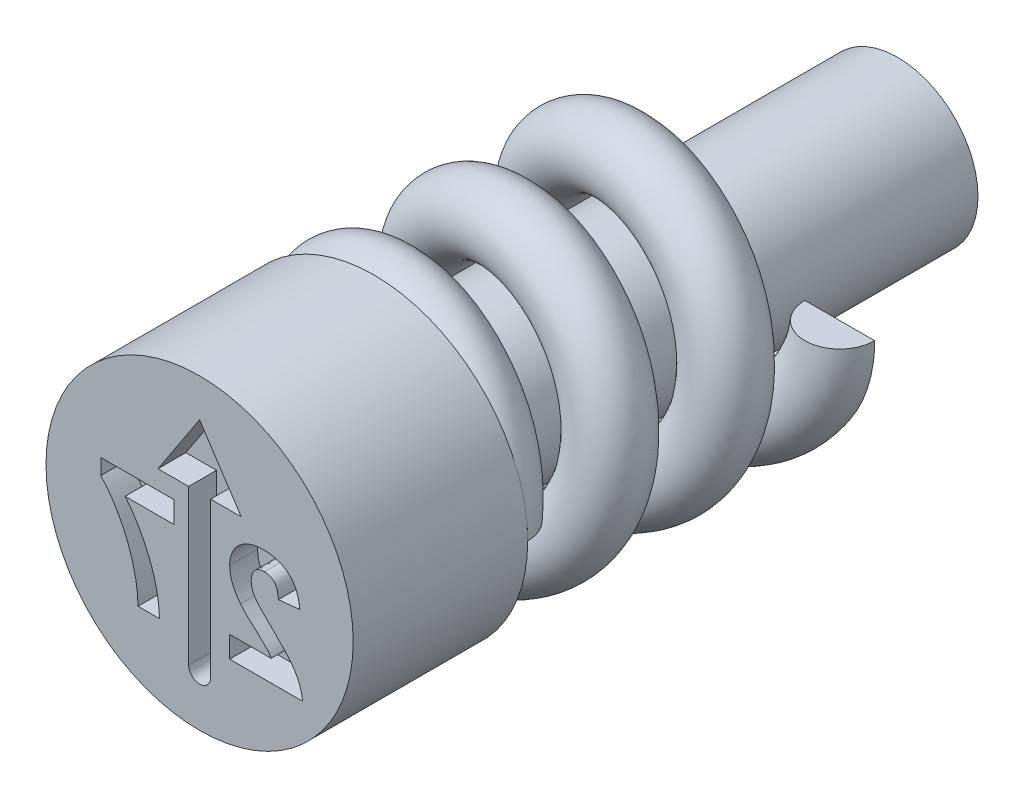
ISO-10303-21;
HEADER;
FILE_DESCRIPTION(('STEP AP214'),'2;1');
FILE_NAME('part.step','',(''),(''),'','','');
FILE_SCHEMA(('AUTOMOTIVE_DESIGN { 1 0 10303 214 1 1 1 1 }'));
ENDSEC;
DATA;
#1=APPLICATION_CONTEXT('core data for automotive mechanical design processes');
#2=APPLICATION_PROTOCOL_DEFINITION('international standard','automotive_design',2000,#1);
#3=PRODUCT_CONTEXT('',#1,'mechanical');
#4=PRODUCT('Part','Part','',(#3));
#5=PRODUCT_RELATED_PRODUCT_CATEGORY('part','',(#4));
#6=PRODUCT_DEFINITION_FORMATION('','',#4);
#7=PRODUCT_DEFINITION_CONTEXT('part definition',#1,'design');
#8=PRODUCT_DEFINITION('design','',#6,#7);
#9=PRODUCT_DEFINITION_SHAPE('','',#8);
#10=(LENGTH_UNIT() NAMED_UNIT(*) SI_UNIT(.MILLI.,.METRE.));
#11=(NAMED_UNIT(*) PLANE_ANGLE_UNIT() SI_UNIT($,.RADIAN.));
#12=(NAMED_UNIT(*) SI_UNIT($,.STERADIAN.) SOLID_ANGLE_UNIT());
#13=UNCERTAINTY_MEASURE_WITH_UNIT(LENGTH_MEASURE(1.E-05),#10,'distance_accuracy_value','');
#14=(GEOMETRIC_REPRESENTATION_CONTEXT(3) GLOBAL_UNCERTAINTY_ASSIGNED_CONTEXT((#13)) GLOBAL_UNIT_ASSIGNED_CONTEXT((#10,
#11,#12)) REPRESENTATION_CONTEXT('',''));
#15=CARTESIAN_POINT('',(0.,0.,0.));
#16=DIRECTION('',(0.,0.,1.));
#17=DIRECTION('',(1.,0.,0.));
#18=AXIS2_PLACEMENT_3D('',#15,#16,#17);
#19=CARTESIAN_POINT('',(1.7,0.,-7.97));
#20=DIRECTION('',(0.,-1.,0.));
#21=DIRECTION('',(0.,0.,-1.));
#22=AXIS2_PLACEMENT_3D('',#19,#20,#21);
#23=PLANE('',#22);
#24=CARTESIAN_POINT('',(1.7,0.,-7.47));
#25=DIRECTION('',(0.,1.,0.));
#26=DIRECTION('',(0.,0.,1.));
#27=AXIS2_PLACEMENT_3D('',#24,#25,#26);
#28=CIRCLE('',#27,0.5);
#29=CARTESIAN_POINT('',(1.2,0.,-7.47));
#30=VERTEX_POINT('',#29);
#31=CARTESIAN_POINT('',(2.2,0.,-7.47));
#32=VERTEX_POINT('',#31);
#33=EDGE_CURVE('E88',#30,#32,#28,.T.);
#34=ORIENTED_EDGE('',*,*,#33,.T.);
#35=DIRECTION('',(-1.,0.,0.));
#36=VECTOR('',#35,1.);
#37=CARTESIAN_POINT('',(1.7,0.,-7.47));
#38=LINE('',#37,#36);
#39=EDGE_CURVE('E75',#32,#30,#38,.T.);
#40=ORIENTED_EDGE('',*,*,#39,.T.);
#41=EDGE_LOOP('',(#34,#40));
#42=FACE_BOUND('',#41,.T.);
#43=ADVANCED_FACE('F49',(#42),#23,.F.);
#44=CARTESIAN_POINT('',(1.7,0.,-3.));
#45=DIRECTION('',(0.,-1.,0.));
#46=DIRECTION('',(0.,0.,-1.));
#47=AXIS2_PLACEMENT_3D('',#44,#45,#46);
#48=PLANE('',#47);
#49=DIRECTION('',(1.,0.,0.));
#50=VECTOR('',#49,1.);
#51=CARTESIAN_POINT('',(1.7,0.,-2.5));
#52=LINE('',#51,#50);
#53=CARTESIAN_POINT('',(1.2,0.,-2.5));
#54=VERTEX_POINT('',#53);
#55=CARTESIAN_POINT('',(2.2,0.,-2.5));
#56=VERTEX_POINT('',#55);
#57=EDGE_CURVE('E69',#54,#56,#52,.T.);
#58=ORIENTED_EDGE('',*,*,#57,.F.);
#59=CARTESIAN_POINT('',(1.7,0.,-2.5));
#60=DIRECTION('',(0.,-1.,0.));
#61=DIRECTION('',(0.,0.,-1.));
#62=AXIS2_PLACEMENT_3D('',#59,#60,#61);
#63=CIRCLE('',#62,0.5);
#64=EDGE_CURVE('E85',#54,#56,#63,.T.);
#65=ORIENTED_EDGE('',*,*,#64,.T.);
#66=EDGE_LOOP('',(#58,#65));
#67=FACE_BOUND('',#66,.T.);
#68=ADVANCED_FACE('F51',(#67),#48,.T.);
#69=CARTESIAN_POINT('',(1.7,0.,-6.97));
#70=CARTESIAN_POINT('',(1.7,-0.704163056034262,-6.86645833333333));
#71=CARTESIAN_POINT('',(1.20208152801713,-1.20208152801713,-6.76291666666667));
#72=CARTESIAN_POINT('',(0.704163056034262,-1.7,-6.659375));
#73=CARTESIAN_POINT('',(0.,-1.7,-6.55583333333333));
#74=CARTESIAN_POINT('',(-0.704163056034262,-1.7,-6.45229166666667));
#75=CARTESIAN_POINT('',(-1.20208152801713,-1.20208152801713,-6.34875));
#76=CARTESIAN_POINT('',(-1.7,-0.704163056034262,-6.24520833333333));
#77=CARTESIAN_POINT('',(-1.7,0.,-6.14166666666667));
#78=CARTESIAN_POINT('',(-1.7,0.704163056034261,-6.038125));
#79=CARTESIAN_POINT('',(-1.20208152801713,1.20208152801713,-5.93458333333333));
#80=CARTESIAN_POINT('',(-0.704163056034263,1.7,-5.83104166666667));
#81=CARTESIAN_POINT('',(0.,1.7,-5.7275));
#82=CARTESIAN_POINT('',(0.704163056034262,1.7,-5.62395833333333));
#83=CARTESIAN_POINT('',(1.20208152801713,1.20208152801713,-5.52041666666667));
#84=CARTESIAN_POINT('',(1.7,0.704163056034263,-5.416875));
#85=CARTESIAN_POINT('',(1.7,0.,-5.31333333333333));
#86=CARTESIAN_POINT('',(1.7,-0.704163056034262,-5.20979166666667));
#87=CARTESIAN_POINT('',(1.20208152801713,-1.20208152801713,-5.10625));
#88=CARTESIAN_POINT('',(0.704163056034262,-1.7,-5.00270833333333));
#89=CARTESIAN_POINT('',(0.,-1.7,-4.89916666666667));
#90=CARTESIAN_POINT('',(-0.704163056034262,-1.7,-4.795625));
#91=CARTESIAN_POINT('',(-1.20208152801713,-1.20208152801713,-4.69208333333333));
#92=CARTESIAN_POINT('',(-1.7,-0.704163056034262,-4.58854166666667));
#93=CARTESIAN_POINT('',(-1.7,0.,-4.485));
#94=CARTESIAN_POINT('',(-1.7,0.704163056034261,-4.38145833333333));
#95=CARTESIAN_POINT('',(-1.20208152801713,1.20208152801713,-4.27791666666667));
#96=CARTESIAN_POINT('',(-0.704163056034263,1.7,-4.174375));
#97=CARTESIAN_POINT('',(0.,1.7,-4.07083333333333));
#98=CARTESIAN_POINT('',(0.704163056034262,1.7,-3.96729166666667));
#99=CARTESIAN_POINT('',(1.20208152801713,1.20208152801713,-3.86375));
#100=CARTESIAN_POINT('',(1.7,0.704163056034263,-3.76020833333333));
#101=CARTESIAN_POINT('',(1.7,0.,-3.65666666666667));
#102=CARTESIAN_POINT('',(1.7,-0.704163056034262,-3.553125));
#103=CARTESIAN_POINT('',(1.20208152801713,-1.20208152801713,-3.44958333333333));
#104=CARTESIAN_POINT('',(0.704163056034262,-1.7,-3.34604166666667));
#105=CARTESIAN_POINT('',(0.,-1.7,-3.2425));
#106=CARTESIAN_POINT('',(-0.704163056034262,-1.7,-3.13895833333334));
#107=CARTESIAN_POINT('',(-1.20208152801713,-1.20208152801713,-3.03541666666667));
#108=CARTESIAN_POINT('',(-1.7,-0.704163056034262,-2.931875));
#109=CARTESIAN_POINT('',(-1.7,0.,-2.82833333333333));
#110=CARTESIAN_POINT('',(-1.7,0.704163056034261,-2.72479166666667));
#111=CARTESIAN_POINT('',(-1.20208152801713,1.20208152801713,-2.62125));
#112=CARTESIAN_POINT('',(-0.704163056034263,1.7,-2.51770833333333));
#113=CARTESIAN_POINT('',(0.,1.7,-2.41416666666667));
#114=CARTESIAN_POINT('',(0.704163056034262,1.7,-2.310625));
#115=CARTESIAN_POINT('',(1.20208152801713,1.20208152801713,-2.20708333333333));
#116=CARTESIAN_POINT('',(1.7,0.704163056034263,-2.10354166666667));
#117=CARTESIAN_POINT('',(1.7,0.,-2.));
#118=CARTESIAN_POINT('',(2.7,0.,-6.97));
#119=CARTESIAN_POINT('',(2.7,-1.11837661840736,-6.86645833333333));
#120=CARTESIAN_POINT('',(1.90918830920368,-1.90918830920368,-6.76291666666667));
#121=CARTESIAN_POINT('',(1.11837661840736,-2.7,-6.659375));
#122=CARTESIAN_POINT('',(0.,-2.7,-6.55583333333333));
#123=CARTESIAN_POINT('',(-1.11837661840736,-2.7,-6.45229166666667));
#124=CARTESIAN_POINT('',(-1.90918830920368,-1.90918830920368,-6.34875));
#125=CARTESIAN_POINT('',(-2.7,-1.11837661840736,-6.24520833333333));
#126=CARTESIAN_POINT('',(-2.7,0.,-6.14166666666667));
#127=CARTESIAN_POINT('',(-2.7,1.11837661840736,-6.038125));
#128=CARTESIAN_POINT('',(-1.90918830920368,1.90918830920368,-5.93458333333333));
#129=CARTESIAN_POINT('',(-1.11837661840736,2.7,-5.83104166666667));
#130=CARTESIAN_POINT('',(0.,2.7,-5.7275));
#131=CARTESIAN_POINT('',(1.11837661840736,2.7,-5.62395833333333));
#132=CARTESIAN_POINT('',(1.90918830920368,1.90918830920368,-5.52041666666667));
#133=CARTESIAN_POINT('',(2.7,1.11837661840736,-5.416875));
#134=CARTESIAN_POINT('',(2.7,0.,-5.31333333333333));
#135=CARTESIAN_POINT('',(2.7,-1.11837661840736,-5.20979166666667));
#136=CARTESIAN_POINT('',(1.90918830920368,-1.90918830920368,-5.10625));
#137=CARTESIAN_POINT('',(1.11837661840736,-2.7,-5.00270833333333));
#138=CARTESIAN_POINT('',(0.,-2.7,-4.89916666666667));
#139=CARTESIAN_POINT('',(-1.11837661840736,-2.7,-4.795625));
#140=CARTESIAN_POINT('',(-1.90918830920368,-1.90918830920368,-4.69208333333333));
#141=CARTESIAN_POINT('',(-2.7,-1.11837661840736,-4.58854166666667));
#142=CARTESIAN_POINT('',(-2.7,0.,-4.485));
#143=CARTESIAN_POINT('',(-2.7,1.11837661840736,-4.38145833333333));
#144=CARTESIAN_POINT('',(-1.90918830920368,1.90918830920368,-4.27791666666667));
#145=CARTESIAN_POINT('',(-1.11837661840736,2.7,-4.174375));
#146=CARTESIAN_POINT('',(0.,2.7,-4.07083333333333));
#147=CARTESIAN_POINT('',(1.11837661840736,2.7,-3.96729166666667));
#148=CARTESIAN_POINT('',(1.90918830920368,1.90918830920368,-3.86375));
#149=CARTESIAN_POINT('',(2.7,1.11837661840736,-3.76020833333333));
#150=CARTESIAN_POINT('',(2.7,0.,-3.65666666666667));
#151=CARTESIAN_POINT('',(2.7,-1.11837661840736,-3.553125));
#152=CARTESIAN_POINT('',(1.90918830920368,-1.90918830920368,-3.44958333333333));
#153=CARTESIAN_POINT('',(1.11837661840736,-2.7,-3.34604166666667));
#154=CARTESIAN_POINT('',(0.,-2.7,-3.2425));
#155=CARTESIAN_POINT('',(-1.11837661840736,-2.7,-3.13895833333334));
#156=CARTESIAN_POINT('',(-1.90918830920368,-1.90918830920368,-3.03541666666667));
#157=CARTESIAN_POINT('',(-2.7,-1.11837661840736,-2.931875));
#158=CARTESIAN_POINT('',(-2.7,0.,-2.82833333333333));
#159=CARTESIAN_POINT('',(-2.7,1.11837661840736,-2.72479166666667));
#160=CARTESIAN_POINT('',(-1.90918830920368,1.90918830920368,-2.62125));
#161=CARTESIAN_POINT('',(-1.11837661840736,2.7,-2.51770833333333));
#162=CARTESIAN_POINT('',(0.,2.7,-2.41416666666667));
#163=CARTESIAN_POINT('',(1.11837661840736,2.7,-2.310625));
#164=CARTESIAN_POINT('',(1.90918830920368,1.90918830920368,-2.20708333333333));
#165=CARTESIAN_POINT('',(2.7,1.11837661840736,-2.10354166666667));
#166=CARTESIAN_POINT('',(2.7,0.,-2.));
#167=CARTESIAN_POINT('',(2.7,0.,-7.97));
#168=CARTESIAN_POINT('',(2.7,-1.11837661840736,-7.86645833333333));
#169=CARTESIAN_POINT('',(1.90918830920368,-1.90918830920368,-7.76291666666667));
#170=CARTESIAN_POINT('',(1.11837661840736,-2.7,-7.659375));
#171=CARTESIAN_POINT('',(0.,-2.7,-7.55583333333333));
#172=CARTESIAN_POINT('',(-1.11837661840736,-2.7,-7.45229166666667));
#173=CARTESIAN_POINT('',(-1.90918830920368,-1.90918830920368,-7.34875));
#174=CARTESIAN_POINT('',(-2.7,-1.11837661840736,-7.24520833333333));
#175=CARTESIAN_POINT('',(-2.7,0.,-7.14166666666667));
#176=CARTESIAN_POINT('',(-2.7,1.11837661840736,-7.038125));
#177=CARTESIAN_POINT('',(-1.90918830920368,1.90918830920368,-6.93458333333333));
#178=CARTESIAN_POINT('',(-1.11837661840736,2.7,-6.83104166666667));
#179=CARTESIAN_POINT('',(0.,2.7,-6.7275));
#180=CARTESIAN_POINT('',(1.11837661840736,2.7,-6.62395833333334));
#181=CARTESIAN_POINT('',(1.90918830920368,1.90918830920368,-6.52041666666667));
#182=CARTESIAN_POINT('',(2.7,1.11837661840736,-6.416875));
#183=CARTESIAN_POINT('',(2.7,0.,-6.31333333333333));
#184=CARTESIAN_POINT('',(2.7,-1.11837661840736,-6.20979166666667));
#185=CARTESIAN_POINT('',(1.90918830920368,-1.90918830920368,-6.10625));
#186=CARTESIAN_POINT('',(1.11837661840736,-2.7,-6.00270833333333));
#187=CARTESIAN_POINT('',(0.,-2.7,-5.89916666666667));
#188=CARTESIAN_POINT('',(-1.11837661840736,-2.7,-5.795625));
#189=CARTESIAN_POINT('',(-1.90918830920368,-1.90918830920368,-5.69208333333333));
#190=CARTESIAN_POINT('',(-2.7,-1.11837661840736,-5.58854166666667));
#191=CARTESIAN_POINT('',(-2.7,0.,-5.485));
#192=CARTESIAN_POINT('',(-2.7,1.11837661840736,-5.38145833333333));
#193=CARTESIAN_POINT('',(-1.90918830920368,1.90918830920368,-5.27791666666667));
#194=CARTESIAN_POINT('',(-1.11837661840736,2.7,-5.174375));
#195=CARTESIAN_POINT('',(0.,2.7,-5.07083333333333));
#196=CARTESIAN_POINT('',(1.11837661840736,2.7,-4.96729166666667));
#197=CARTESIAN_POINT('',(1.90918830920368,1.90918830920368,-4.86375));
#198=CARTESIAN_POINT('',(2.7,1.11837661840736,-4.76020833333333));
#199=CARTESIAN_POINT('',(2.7,0.,-4.65666666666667));
#200=CARTESIAN_POINT('',(2.7,-1.11837661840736,-4.553125));
#201=CARTESIAN_POINT('',(1.90918830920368,-1.90918830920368,-4.44958333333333));
#202=CARTESIAN_POINT('',(1.11837661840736,-2.7,-4.34604166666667));
#203=CARTESIAN_POINT('',(0.,-2.7,-4.2425));
#204=CARTESIAN_POINT('',(-1.11837661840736,-2.7,-4.13895833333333));
#205=CARTESIAN_POINT('',(-1.90918830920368,-1.90918830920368,-4.03541666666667));
#206=CARTESIAN_POINT('',(-2.7,-1.11837661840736,-3.931875));
#207=CARTESIAN_POINT('',(-2.7,0.,-3.82833333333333));
#208=CARTESIAN_POINT('',(-2.7,1.11837661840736,-3.72479166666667));
#209=CARTESIAN_POINT('',(-1.90918830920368,1.90918830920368,-3.62125));
#210=CARTESIAN_POINT('',(-1.11837661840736,2.7,-3.51770833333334));
#211=CARTESIAN_POINT('',(0.,2.7,-3.41416666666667));
#212=CARTESIAN_POINT('',(1.11837661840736,2.7,-3.310625));
#213=CARTESIAN_POINT('',(1.90918830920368,1.90918830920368,-3.20708333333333));
#214=CARTESIAN_POINT('',(2.7,1.11837661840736,-3.10354166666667));
#215=CARTESIAN_POINT('',(2.7,0.,-3.));
#216=CARTESIAN_POINT('',(1.7,0.,-7.97));
#217=CARTESIAN_POINT('',(1.7,-0.704163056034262,-7.86645833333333));
#218=CARTESIAN_POINT('',(1.20208152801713,-1.20208152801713,-7.76291666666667));
#219=CARTESIAN_POINT('',(0.704163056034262,-1.7,-7.659375));
#220=CARTESIAN_POINT('',(0.,-1.7,-7.55583333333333));
#221=CARTESIAN_POINT('',(-0.704163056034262,-1.7,-7.45229166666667));
#222=CARTESIAN_POINT('',(-1.20208152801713,-1.20208152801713,-7.34875));
#223=CARTESIAN_POINT('',(-1.7,-0.704163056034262,-7.24520833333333));
#224=CARTESIAN_POINT('',(-1.7,0.,-7.14166666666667));
#225=CARTESIAN_POINT('',(-1.7,0.704163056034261,-7.038125));
#226=CARTESIAN_POINT('',(-1.20208152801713,1.20208152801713,-6.93458333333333));
#227=CARTESIAN_POINT('',(-0.704163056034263,1.7,-6.83104166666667));
#228=CARTESIAN_POINT('',(0.,1.7,-6.7275));
#229=CARTESIAN_POINT('',(0.704163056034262,1.7,-6.62395833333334));
#230=CARTESIAN_POINT('',(1.20208152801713,1.20208152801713,-6.52041666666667));
#231=CARTESIAN_POINT('',(1.7,0.704163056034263,-6.416875));
#232=CARTESIAN_POINT('',(1.7,0.,-6.31333333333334));
#233=CARTESIAN_POINT('',(1.7,-0.704163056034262,-6.20979166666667));
#234=CARTESIAN_POINT('',(1.20208152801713,-1.20208152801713,-6.10625));
#235=CARTESIAN_POINT('',(0.704163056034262,-1.7,-6.00270833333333));
#236=CARTESIAN_POINT('',(0.,-1.7,-5.89916666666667));
#237=CARTESIAN_POINT('',(-0.704163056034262,-1.7,-5.795625));
#238=CARTESIAN_POINT('',(-1.20208152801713,-1.20208152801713,-5.69208333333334));
#239=CARTESIAN_POINT('',(-1.7,-0.704163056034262,-5.58854166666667));
#240=CARTESIAN_POINT('',(-1.7,0.,-5.485));
#241=CARTESIAN_POINT('',(-1.7,0.704163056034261,-5.38145833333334));
#242=CARTESIAN_POINT('',(-1.20208152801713,1.20208152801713,-5.27791666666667));
#243=CARTESIAN_POINT('',(-0.704163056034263,1.7,-5.174375));
#244=CARTESIAN_POINT('',(0.,1.7,-5.07083333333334));
#245=CARTESIAN_POINT('',(0.704163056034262,1.7,-4.96729166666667));
#246=CARTESIAN_POINT('',(1.20208152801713,1.20208152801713,-4.86375));
#247=CARTESIAN_POINT('',(1.7,0.704163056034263,-4.76020833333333));
#248=CARTESIAN_POINT('',(1.7,0.,-4.65666666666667));
#249=CARTESIAN_POINT('',(1.7,-0.704163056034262,-4.553125));
#250=CARTESIAN_POINT('',(1.20208152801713,-1.20208152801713,-4.44958333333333));
#251=CARTESIAN_POINT('',(0.704163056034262,-1.7,-4.34604166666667));
#252=CARTESIAN_POINT('',(0.,-1.7,-4.2425));
#253=CARTESIAN_POINT('',(-0.704163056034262,-1.7,-4.13895833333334));
#254=CARTESIAN_POINT('',(-1.20208152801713,-1.20208152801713,-4.03541666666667));
#255=CARTESIAN_POINT('',(-1.7,-0.704163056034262,-3.931875));
#256=CARTESIAN_POINT('',(-1.7,0.,-3.82833333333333));
#257=CARTESIAN_POINT('',(-1.7,0.704163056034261,-3.72479166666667));
#258=CARTESIAN_POINT('',(-1.20208152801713,1.20208152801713,-3.62125));
#259=CARTESIAN_POINT('',(-0.704163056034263,1.7,-3.51770833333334));
#260=CARTESIAN_POINT('',(0.,1.7,-3.41416666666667));
#261=CARTESIAN_POINT('',(0.704163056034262,1.7,-3.310625));
#262=CARTESIAN_POINT('',(1.20208152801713,1.20208152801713,-3.20708333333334));
#263=CARTESIAN_POINT('',(1.7,0.704163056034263,-3.10354166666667));
#264=CARTESIAN_POINT('',(1.7,0.,-3.));
#265=CARTESIAN_POINT('',(0.7,0.,-7.97));
#266=CARTESIAN_POINT('',(0.7,-0.289949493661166,-7.86645833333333));
#267=CARTESIAN_POINT('',(0.494974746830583,-0.494974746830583,-7.76291666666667));
#268=CARTESIAN_POINT('',(0.289949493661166,-0.7,-7.659375));
#269=CARTESIAN_POINT('',(0.,-0.7,-7.55583333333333));
#270=CARTESIAN_POINT('',(-0.289949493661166,-0.7,-7.45229166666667));
#271=CARTESIAN_POINT('',(-0.494974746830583,-0.494974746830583,-7.34875));
#272=CARTESIAN_POINT('',(-0.7,-0.289949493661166,-7.24520833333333));
#273=CARTESIAN_POINT('',(-0.7,0.,-7.14166666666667));
#274=CARTESIAN_POINT('',(-0.7,0.289949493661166,-7.038125));
#275=CARTESIAN_POINT('',(-0.494974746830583,0.494974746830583,-6.93458333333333));
#276=CARTESIAN_POINT('',(-0.289949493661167,0.7,-6.83104166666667));
#277=CARTESIAN_POINT('',(0.,0.7,-6.7275));
#278=CARTESIAN_POINT('',(0.289949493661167,0.7,-6.62395833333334));
#279=CARTESIAN_POINT('',(0.494974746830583,0.494974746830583,-6.52041666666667));
#280=CARTESIAN_POINT('',(0.7,0.289949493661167,-6.416875));
#281=CARTESIAN_POINT('',(0.7,0.,-6.31333333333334));
#282=CARTESIAN_POINT('',(0.7,-0.289949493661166,-6.20979166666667));
#283=CARTESIAN_POINT('',(0.494974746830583,-0.494974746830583,-6.10625));
#284=CARTESIAN_POINT('',(0.289949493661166,-0.7,-6.00270833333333));
#285=CARTESIAN_POINT('',(0.,-0.7,-5.89916666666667));
#286=CARTESIAN_POINT('',(-0.289949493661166,-0.7,-5.795625));
#287=CARTESIAN_POINT('',(-0.494974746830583,-0.494974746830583,-5.69208333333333));
#288=CARTESIAN_POINT('',(-0.7,-0.289949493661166,-5.58854166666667));
#289=CARTESIAN_POINT('',(-0.7,0.,-5.485));
#290=CARTESIAN_POINT('',(-0.7,0.289949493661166,-5.38145833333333));
#291=CARTESIAN_POINT('',(-0.494974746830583,0.494974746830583,-5.27791666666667));
#292=CARTESIAN_POINT('',(-0.289949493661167,0.7,-5.174375));
#293=CARTESIAN_POINT('',(0.,0.7,-5.07083333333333));
#294=CARTESIAN_POINT('',(0.289949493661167,0.7,-4.96729166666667));
#295=CARTESIAN_POINT('',(0.494974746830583,0.494974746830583,-4.86375));
#296=CARTESIAN_POINT('',(0.7,0.289949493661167,-4.76020833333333));
#297=CARTESIAN_POINT('',(0.7,0.,-4.65666666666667));
#298=CARTESIAN_POINT('',(0.7,-0.289949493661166,-4.553125));
#299=CARTESIAN_POINT('',(0.494974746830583,-0.494974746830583,-4.44958333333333));
#300=CARTESIAN_POINT('',(0.289949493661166,-0.7,-4.34604166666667));
#301=CARTESIAN_POINT('',(0.,-0.7,-4.2425));
#302=CARTESIAN_POINT('',(-0.289949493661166,-0.7,-4.13895833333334));
#303=CARTESIAN_POINT('',(-0.494974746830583,-0.494974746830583,-4.03541666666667));
#304=CARTESIAN_POINT('',(-0.7,-0.289949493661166,-3.931875));
#305=CARTESIAN_POINT('',(-0.7,0.,-3.82833333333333));
#306=CARTESIAN_POINT('',(-0.7,0.289949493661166,-3.72479166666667));
#307=CARTESIAN_POINT('',(-0.494974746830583,0.494974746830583,-3.62125));
#308=CARTESIAN_POINT('',(-0.289949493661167,0.7,-3.51770833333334));
#309=CARTESIAN_POINT('',(0.,0.7,-3.41416666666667));
#310=CARTESIAN_POINT('',(0.289949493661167,0.7,-3.310625));
#311=CARTESIAN_POINT('',(0.494974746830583,0.494974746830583,-3.20708333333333));
#312=CARTESIAN_POINT('',(0.7,0.289949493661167,-3.10354166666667));
#313=CARTESIAN_POINT('',(0.7,0.,-3.));
#314=CARTESIAN_POINT('',(0.7,0.,-6.97));
#315=CARTESIAN_POINT('',(0.7,-0.289949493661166,-6.86645833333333));
#316=CARTESIAN_POINT('',(0.494974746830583,-0.494974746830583,-6.76291666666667));
#317=CARTESIAN_POINT('',(0.289949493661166,-0.7,-6.659375));
#318=CARTESIAN_POINT('',(0.,-0.7,-6.55583333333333));
#319=CARTESIAN_POINT('',(-0.289949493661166,-0.7,-6.45229166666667));
#320=CARTESIAN_POINT('',(-0.494974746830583,-0.494974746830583,-6.34875));
#321=CARTESIAN_POINT('',(-0.7,-0.289949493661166,-6.24520833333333));
#322=CARTESIAN_POINT('',(-0.7,0.,-6.14166666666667));
#323=CARTESIAN_POINT('',(-0.7,0.289949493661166,-6.038125));
#324=CARTESIAN_POINT('',(-0.494974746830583,0.494974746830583,-5.93458333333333));
#325=CARTESIAN_POINT('',(-0.289949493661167,0.7,-5.83104166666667));
#326=CARTESIAN_POINT('',(0.,0.7,-5.7275));
#327=CARTESIAN_POINT('',(0.289949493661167,0.7,-5.62395833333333));
#328=CARTESIAN_POINT('',(0.494974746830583,0.494974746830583,-5.52041666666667));
#329=CARTESIAN_POINT('',(0.7,0.289949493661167,-5.416875));
#330=CARTESIAN_POINT('',(0.7,0.,-5.31333333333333));
#331=CARTESIAN_POINT('',(0.7,-0.289949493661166,-5.20979166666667));
#332=CARTESIAN_POINT('',(0.494974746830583,-0.494974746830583,-5.10625));
#333=CARTESIAN_POINT('',(0.289949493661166,-0.7,-5.00270833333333));
#334=CARTESIAN_POINT('',(0.,-0.7,-4.89916666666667));
#335=CARTESIAN_POINT('',(-0.289949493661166,-0.7,-4.795625));
#336=CARTESIAN_POINT('',(-0.494974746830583,-0.494974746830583,-4.69208333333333));
#337=CARTESIAN_POINT('',(-0.7,-0.289949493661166,-4.58854166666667));
#338=CARTESIAN_POINT('',(-0.7,0.,-4.485));
#339=CARTESIAN_POINT('',(-0.7,0.289949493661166,-4.38145833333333));
#340=CARTESIAN_POINT('',(-0.494974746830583,0.494974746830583,-4.27791666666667));
#341=CARTESIAN_POINT('',(-0.289949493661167,0.7,-4.174375));
#342=CARTESIAN_POINT('',(0.,0.7,-4.07083333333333));
#343=CARTESIAN_POINT('',(0.289949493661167,0.7,-3.96729166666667));
#344=CARTESIAN_POINT('',(0.494974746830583,0.494974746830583,-3.86375));
#345=CARTESIAN_POINT('',(0.7,0.289949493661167,-3.76020833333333));
#346=CARTESIAN_POINT('',(0.7,0.,-3.65666666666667));
#347=CARTESIAN_POINT('',(0.7,-0.289949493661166,-3.553125));
#348=CARTESIAN_POINT('',(0.494974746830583,-0.494974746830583,-3.44958333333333));
#349=CARTESIAN_POINT('',(0.289949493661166,-0.7,-3.34604166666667));
#350=CARTESIAN_POINT('',(0.,-0.7,-3.2425));
#351=CARTESIAN_POINT('',(-0.289949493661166,-0.7,-3.13895833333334));
#352=CARTESIAN_POINT('',(-0.494974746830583,-0.494974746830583,-3.03541666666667));
#353=CARTESIAN_POINT('',(-0.7,-0.289949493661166,-2.931875));
#354=CARTESIAN_POINT('',(-0.7,0.,-2.82833333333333));
#355=CARTESIAN_POINT('',(-0.7,0.289949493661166,-2.72479166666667));
#356=CARTESIAN_POINT('',(-0.494974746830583,0.494974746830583,-2.62125));
#357=CARTESIAN_POINT('',(-0.289949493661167,0.7,-2.51770833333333));
#358=CARTESIAN_POINT('',(0.,0.7,-2.41416666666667));
#359=CARTESIAN_POINT('',(0.289949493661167,0.7,-2.310625));
#360=CARTESIAN_POINT('',(0.494974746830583,0.494974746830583,-2.20708333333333));
#361=CARTESIAN_POINT('',(0.7,0.289949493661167,-2.10354166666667));
#362=CARTESIAN_POINT('',(0.7,0.,-2.));
#363=CARTESIAN_POINT('',(1.7,0.,-6.97));
#364=CARTESIAN_POINT('',(1.7,-0.704163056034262,-6.86645833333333));
#365=CARTESIAN_POINT('',(1.20208152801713,-1.20208152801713,-6.76291666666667));
#366=CARTESIAN_POINT('',(0.704163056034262,-1.7,-6.659375));
#367=CARTESIAN_POINT('',(0.,-1.7,-6.55583333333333));
#368=CARTESIAN_POINT('',(-0.704163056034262,-1.7,-6.45229166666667));
#369=CARTESIAN_POINT('',(-1.20208152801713,-1.20208152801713,-6.34875));
#370=CARTESIAN_POINT('',(-1.7,-0.704163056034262,-6.24520833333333));
#371=CARTESIAN_POINT('',(-1.7,0.,-6.14166666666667));
#372=CARTESIAN_POINT('',(-1.7,0.704163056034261,-6.038125));
#373=CARTESIAN_POINT('',(-1.20208152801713,1.20208152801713,-5.93458333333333));
#374=CARTESIAN_POINT('',(-0.704163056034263,1.7,-5.83104166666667));
#375=CARTESIAN_POINT('',(0.,1.7,-5.7275));
#376=CARTESIAN_POINT('',(0.704163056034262,1.7,-5.62395833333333));
#377=CARTESIAN_POINT('',(1.20208152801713,1.20208152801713,-5.52041666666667));
#378=CARTESIAN_POINT('',(1.7,0.704163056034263,-5.416875));
#379=CARTESIAN_POINT('',(1.7,0.,-5.31333333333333));
#380=CARTESIAN_POINT('',(1.7,-0.704163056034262,-5.20979166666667));
#381=CARTESIAN_POINT('',(1.20208152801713,-1.20208152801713,-5.10625));
#382=CARTESIAN_POINT('',(0.704163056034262,-1.7,-5.00270833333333));
#383=CARTESIAN_POINT('',(0.,-1.7,-4.89916666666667));
#384=CARTESIAN_POINT('',(-0.704163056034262,-1.7,-4.795625));
#385=CARTESIAN_POINT('',(-1.20208152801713,-1.20208152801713,-4.69208333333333));
#386=CARTESIAN_POINT('',(-1.7,-0.704163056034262,-4.58854166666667));
#387=CARTESIAN_POINT('',(-1.7,0.,-4.485));
#388=CARTESIAN_POINT('',(-1.7,0.704163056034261,-4.38145833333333));
#389=CARTESIAN_POINT('',(-1.20208152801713,1.20208152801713,-4.27791666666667));
#390=CARTESIAN_POINT('',(-0.704163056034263,1.7,-4.174375));
#391=CARTESIAN_POINT('',(0.,1.7,-4.07083333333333));
#392=CARTESIAN_POINT('',(0.704163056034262,1.7,-3.96729166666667));
#393=CARTESIAN_POINT('',(1.20208152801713,1.20208152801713,-3.86375));
#394=CARTESIAN_POINT('',(1.7,0.704163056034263,-3.76020833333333));
#395=CARTESIAN_POINT('',(1.7,0.,-3.65666666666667));
#396=CARTESIAN_POINT('',(1.7,-0.704163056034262,-3.553125));
#397=CARTESIAN_POINT('',(1.20208152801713,-1.20208152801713,-3.44958333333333));
#398=CARTESIAN_POINT('',(0.704163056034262,-1.7,-3.34604166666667));
#399=CARTESIAN_POINT('',(0.,-1.7,-3.2425));
#400=CARTESIAN_POINT('',(-0.704163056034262,-1.7,-3.13895833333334));
#401=CARTESIAN_POINT('',(-1.20208152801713,-1.20208152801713,-3.03541666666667));
#402=CARTESIAN_POINT('',(-1.7,-0.704163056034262,-2.931875));
#403=CARTESIAN_POINT('',(-1.7,0.,-2.82833333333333));
#404=CARTESIAN_POINT('',(-1.7,0.704163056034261,-2.72479166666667));
#405=CARTESIAN_POINT('',(-1.20208152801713,1.20208152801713,-2.62125));
#406=CARTESIAN_POINT('',(-0.704163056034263,1.7,-2.51770833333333));
#407=CARTESIAN_POINT('',(0.,1.7,-2.41416666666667));
#408=CARTESIAN_POINT('',(0.704163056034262,1.7,-2.310625));
#409=CARTESIAN_POINT('',(1.20208152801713,1.20208152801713,-2.20708333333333));
#410=CARTESIAN_POINT('',(1.7,0.704163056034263,-2.10354166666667));
#411=CARTESIAN_POINT('',(1.7,0.,-2.));
#412=(BOUNDED_SURFACE() B_SPLINE_SURFACE(3,2,((#69,#70,#71,#72,#73,#74,#75,#76,#77,#78,#79,#80,
#81,#82,#83,#84,#85,#86,#87,#88,#89,#90,#91,#92,#93,#94,#95,#96,#97,#98,#99,#100,#101,#102,#103,
#104,#105,#106,#107,#108,#109,#110,#111,#112,#113,#114,#115,#116,#117),(#118,#119,#120,#121,
#122,#123,#124,#125,#126,#127,#128,#129,#130,#131,#132,#133,#134,#135,#136,#137,#138,#139,#140,
#141,#142,#143,#144,#145,#146,#147,#148,#149,#150,#151,#152,#153,#154,#155,#156,#157,#158,#159,
#160,#161,#162,#163,#164,#165,#166),(#167,#168,#169,#170,#171,#172,#173,#174,#175,#176,#177,
#178,#179,#180,#181,#182,#183,#184,#185,#186,#187,#188,#189,#190,#191,#192,#193,#194,#195,#196,
#197,#198,#199,#200,#201,#202,#203,#204,#205,#206,#207,#208,#209,#210,#211,#212,#213,#214,#215),
(#216,#217,#218,#219,#220,#221,#222,#223,#224,#225,#226,#227,#228,#229,#230,#231,#232,#233,#234,
#235,#236,#237,#238,#239,#240,#241,#242,#243,#244,#245,#246,#247,#248,#249,#250,#251,#252,#253,
#254,#255,#256,#257,#258,#259,#260,#261,#262,#263,#264),(#265,#266,#267,#268,#269,#270,#271,
#272,#273,#274,#275,#276,#277,#278,#279,#280,#281,#282,#283,#284,#285,#286,#287,#288,#289,#290,
#291,#292,#293,#294,#295,#296,#297,#298,#299,#300,#301,#302,#303,#304,#305,#306,#307,#308,#309,
#310,#311,#312,#313),(#314,#315,#316,#317,#318,#319,#320,#321,#322,#323,#324,#325,#326,#327,
#328,#329,#330,#331,#332,#333,#334,#335,#336,#337,#338,#339,#340,#341,#342,#343,#344,#345,#346,
#347,#348,#349,#350,#351,#352,#353,#354,#355,#356,#357,#358,#359,#360,#361,#362),(#363,#364,
#365,#366,#367,#368,#369,#370,#371,#372,#373,#374,#375,#376,#377,#378,#379,#380,#381,#382,#383,
#384,#385,#386,#387,#388,#389,#390,#391,#392,#393,#394,#395,#396,#397,#398,#399,#400,#401,#402,
#403,#404,#405,#406,#407,#408,#409,#410,#411)),.UNSPECIFIED.,.T.,.F.,
.F.) B_SPLINE_SURFACE_WITH_KNOTS((4,3,4),(3,2,2,2,2,2,2,2,2,2,2,2,2,2,2,2,2,2,2,2,2,2,2,2,3),
(0.,0.5,1.),(0.,0.0416666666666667,0.0833333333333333,0.125,0.166666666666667,0.208333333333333,
0.25,0.291666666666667,0.333333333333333,0.375,0.416666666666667,0.458333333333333,0.5,
0.541666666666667,0.583333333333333,0.625,0.666666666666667,0.708333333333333,0.75,
0.791666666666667,0.833333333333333,0.875,0.916666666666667,0.958333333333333,1.),
.UNSPECIFIED.) GEOMETRIC_REPRESENTATION_ITEM() RATIONAL_B_SPLINE_SURFACE(((1.,0.923879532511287,
1.,0.923879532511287,1.,0.923879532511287,1.,0.923879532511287,1.,0.923879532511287,1.,
0.923879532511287,1.,0.923879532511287,1.,0.923879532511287,1.,0.923879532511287,1.,
0.923879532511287,1.,0.923879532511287,1.,0.923879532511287,1.,0.923879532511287,1.,
0.923879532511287,1.,0.923879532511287,1.,0.923879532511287,1.,0.923879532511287,1.,
0.923879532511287,1.,0.923879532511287,1.,0.923879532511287,1.,0.923879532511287,1.,
0.923879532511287,1.,0.923879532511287,1.,0.923879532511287,1.),(0.333333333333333,
0.307959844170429,0.333333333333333,0.307959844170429,0.333333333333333,0.307959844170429,
0.333333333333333,0.307959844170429,0.333333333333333,0.307959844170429,0.333333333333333,
0.307959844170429,0.333333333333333,0.307959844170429,0.333333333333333,0.307959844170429,
0.333333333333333,0.307959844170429,0.333333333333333,0.307959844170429,0.333333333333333,
0.307959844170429,0.333333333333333,0.307959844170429,0.333333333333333,0.307959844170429,
0.333333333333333,0.307959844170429,0.333333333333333,0.307959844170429,0.333333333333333,
0.307959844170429,0.333333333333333,0.307959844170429,0.333333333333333,0.307959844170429,
0.333333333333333,0.307959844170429,0.333333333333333,0.307959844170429,0.333333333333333,
0.307959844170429,0.333333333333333,0.307959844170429,0.333333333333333,0.307959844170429,
0.333333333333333,0.307959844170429,0.333333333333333),(0.333333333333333,0.307959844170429,
0.333333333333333,0.307959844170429,0.333333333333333,0.307959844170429,0.333333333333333,
0.307959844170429,0.333333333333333,0.307959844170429,0.333333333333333,0.307959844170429,
0.333333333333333,0.307959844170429,0.333333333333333,0.307959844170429,0.333333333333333,
0.307959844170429,0.333333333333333,0.307959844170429,0.333333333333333,0.307959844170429,
0.333333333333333,0.307959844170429,0.333333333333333,0.307959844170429,0.333333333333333,
0.307959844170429,0.333333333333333,0.307959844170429,0.333333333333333,0.307959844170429,
0.333333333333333,0.307959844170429,0.333333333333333,0.307959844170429,0.333333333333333,
0.307959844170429,0.333333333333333,0.307959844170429,0.333333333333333,0.307959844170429,
0.333333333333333,0.307959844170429,0.333333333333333,0.307959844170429,0.333333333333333,
0.307959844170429,0.333333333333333),(1.,0.923879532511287,1.,0.923879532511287,1.,
0.923879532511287,1.,0.923879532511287,1.,0.923879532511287,1.,0.923879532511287,1.,
0.923879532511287,1.,0.923879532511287,1.,0.923879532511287,1.,0.923879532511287,1.,
0.923879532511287,1.,0.923879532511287,1.,0.923879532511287,1.,0.923879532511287,1.,
0.923879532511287,1.,0.923879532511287,1.,0.923879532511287,1.,0.923879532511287,1.,
0.923879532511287,1.,0.923879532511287,1.,0.923879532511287,1.,0.923879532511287,1.,
0.923879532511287,1.,0.923879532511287,1.),(0.333333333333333,0.307959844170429,
0.333333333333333,0.307959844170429,0.333333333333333,0.307959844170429,0.333333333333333,
0.307959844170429,0.333333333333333,0.307959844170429,0.333333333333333,0.307959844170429,
0.333333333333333,0.307959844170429,0.333333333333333,0.307959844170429,0.333333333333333,
0.307959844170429,0.333333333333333,0.307959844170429,0.333333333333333,0.307959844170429,
0.333333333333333,0.307959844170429,0.333333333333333,0.307959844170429,0.333333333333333,
0.307959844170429,0.333333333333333,0.307959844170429,0.333333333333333,0.307959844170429,
0.333333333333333,0.307959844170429,0.333333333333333,0.307959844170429,0.333333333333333,
0.307959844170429,0.333333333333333,0.307959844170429,0.333333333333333,0.307959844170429,
0.333333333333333,0.307959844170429,0.333333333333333,0.307959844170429,0.333333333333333,
0.307959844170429,0.333333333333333),(0.333333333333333,0.307959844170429,0.333333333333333,
0.307959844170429,0.333333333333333,0.307959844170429,0.333333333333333,0.307959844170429,
0.333333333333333,0.307959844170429,0.333333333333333,0.307959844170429,0.333333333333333,
0.307959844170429,0.333333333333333,0.307959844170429,0.333333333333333,0.307959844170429,
0.333333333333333,0.307959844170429,0.333333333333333,0.307959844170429,0.333333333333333,
0.307959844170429,0.333333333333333,0.307959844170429,0.333333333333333,0.307959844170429,
0.333333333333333,0.307959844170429,0.333333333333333,0.307959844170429,0.333333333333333,
0.307959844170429,0.333333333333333,0.307959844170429,0.333333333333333,0.307959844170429,
0.333333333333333,0.307959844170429,0.333333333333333,0.307959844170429,0.333333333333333,
0.307959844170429,0.333333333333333,0.307959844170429,0.333333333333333,0.307959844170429,
0.333333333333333),(1.,0.923879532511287,1.,0.923879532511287,1.,0.923879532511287,1.,
0.923879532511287,1.,0.923879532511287,1.,0.923879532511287,1.,0.923879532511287,1.,
0.923879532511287,1.,0.923879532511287,1.,0.923879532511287,1.,0.923879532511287,1.,
0.923879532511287,1.,0.923879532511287,1.,0.923879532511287,1.,0.923879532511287,1.,
0.923879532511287,1.,0.923879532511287,1.,0.923879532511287,1.,0.923879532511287,1.,
0.923879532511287,1.,0.923879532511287,1.,0.923879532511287,1.,0.923879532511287,1.,
0.923879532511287,1.))) REPRESENTATION_ITEM('') SURFACE());
#413=CARTESIAN_POINT('',(1.2,0.,-7.47));
#414=CARTESIAN_POINT('',(1.20002672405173,-0.0763580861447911,-7.47));
#415=CARTESIAN_POINT('',(1.19347278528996,-0.152642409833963,-7.47));
#416=CARTESIAN_POINT('',(1.16782519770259,-0.303018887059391,-7.47));
#417=CARTESIAN_POINT('',(1.14874142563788,-0.377112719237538,-7.47));
#418=CARTESIAN_POINT('',(1.09844290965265,-0.521796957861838,-7.47));
#419=CARTESIAN_POINT('',(1.06712732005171,-0.592352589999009,-7.47));
#420=CARTESIAN_POINT('',(1.01179346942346,-0.693491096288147,-7.47));
#421=CARTESIAN_POINT('',(0.991953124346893,-0.726424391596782,-7.47));
#422=CARTESIAN_POINT('',(0.949591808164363,-0.790530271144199,-7.47));
#423=CARTESIAN_POINT('',(0.927071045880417,-0.821702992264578,-7.47));
#424=CARTESIAN_POINT('',(0.879281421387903,-0.882331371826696,-7.47));
#425=CARTESIAN_POINT('',(0.853988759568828,-0.911768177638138,-7.47));
#426=CARTESIAN_POINT('',(0.801248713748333,-0.968644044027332,-7.47));
#427=CARTESIAN_POINT('',(0.773800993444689,-0.996082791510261,-7.47));
#428=CARTESIAN_POINT('',(0.716874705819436,-1.04885697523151,-7.47));
#429=CARTESIAN_POINT('',(0.687393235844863,-1.07418928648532,-7.47));
#430=CARTESIAN_POINT('',(0.626669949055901,-1.12262068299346,-7.47));
#431=CARTESIAN_POINT('',(0.595428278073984,-1.14571995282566,-7.47));
#432=CARTESIAN_POINT('',(0.492201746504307,-1.21645477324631,-7.47));
#433=CARTESIAN_POINT('',(0.417051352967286,-1.2596068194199,-7.46999999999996));
#434=CARTESIAN_POINT('',(0.300368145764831,-1.31552525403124,-7.47000000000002));
#435=CARTESIAN_POINT('',(0.26084019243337,-1.33268844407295,-7.47000000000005));
#436=CARTESIAN_POINT('',(0.18066821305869,-1.36416861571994,-7.46999999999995));
#437=CARTESIAN_POINT('',(0.140024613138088,-1.37848666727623,-7.46999999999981));
#438=CARTESIAN_POINT('',(0.0814725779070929,-1.39696884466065,-7.46999999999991));
#439=CARTESIAN_POINT('',(0.0639045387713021,-1.4022440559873,-7.46999999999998));
#440=CARTESIAN_POINT('',(0.0286265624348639,-1.41229164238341,-7.47000000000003));
#441=CARTESIAN_POINT('',(0.0109166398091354,-1.41706406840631,-7.47000000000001));
#442=CARTESIAN_POINT('',(-0.0245998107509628,-1.42624482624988,-7.46999999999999));
#443=CARTESIAN_POINT('',(-0.0424063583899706,-1.4306530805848,-7.47));
#444=CARTESIAN_POINT('',(-0.0780824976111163,-1.43920892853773,-7.47));
#445=CARTESIAN_POINT('',(-0.0959520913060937,-1.44335651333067,-7.47));
#446=CARTESIAN_POINT('',(-0.14967052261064,-1.45549210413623,-7.47));
#447=CARTESIAN_POINT('',(-0.185589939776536,-1.46316314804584,-7.47));
#448=CARTESIAN_POINT('',(-0.257424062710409,-1.47845607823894,-7.47000000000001));
#449=CARTESIAN_POINT('',(-0.293338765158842,-1.48607798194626,-7.47000000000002));
#450=CARTESIAN_POINT('',(-0.351750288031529,-1.49993361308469,-7.46999999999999));
#451=CARTESIAN_POINT('',(-0.37435802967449,-1.50565798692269,-7.46999999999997));
#452=CARTESIAN_POINT('',(-0.40792349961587,-1.5155597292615,-7.47000000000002));
#453=CARTESIAN_POINT('',(-0.419068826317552,-1.51908505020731,-7.47000000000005));
#454=CARTESIAN_POINT('',(-0.441119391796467,-1.52681030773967,-7.46999999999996));
#455=CARTESIAN_POINT('',(-0.452024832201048,-1.53100965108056,-7.46999999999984));
#456=CARTESIAN_POINT('',(-0.473552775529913,-1.54052024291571,-7.47000000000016));
#457=CARTESIAN_POINT('',(-0.484168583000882,-1.54584722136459,-7.47000000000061));
#458=CARTESIAN_POINT('',(-0.504355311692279,-1.55813278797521,-7.46999999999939));
#459=CARTESIAN_POINT('',(-0.513934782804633,-1.56507624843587,-7.46999999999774));
#460=CARTESIAN_POINT('',(-0.529556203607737,-1.58027025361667,-7.46999999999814));
#461=CARTESIAN_POINT('',(-0.535914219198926,-1.58816339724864,-7.46999999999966));
#462=CARTESIAN_POINT('',(-0.543124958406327,-1.60135076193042,-7.47000000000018));
#463=CARTESIAN_POINT('',(-0.545145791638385,-1.60600317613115,-7.47000000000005));
#464=CARTESIAN_POINT('',(-0.548264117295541,-1.61560720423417,-7.46999999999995));
#465=CARTESIAN_POINT('',(-0.549361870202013,-1.6205587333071,-7.46999999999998));
#466=CARTESIAN_POINT('',(-0.551100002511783,-1.63452581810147,-7.47000000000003));
#467=CARTESIAN_POINT('',(-0.550700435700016,-1.64367280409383,-7.47000000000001));
#468=CARTESIAN_POINT('',(-0.546725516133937,-1.66683098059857,-7.46999999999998));
#469=CARTESIAN_POINT('',(-0.541393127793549,-1.68047815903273,-7.46999999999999));
#470=CARTESIAN_POINT('',(-0.528433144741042,-1.70512124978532,-7.47000000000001));
#471=CARTESIAN_POINT('',(-0.521005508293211,-1.71623880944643,-7.47000000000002));
#472=CARTESIAN_POINT('',(-0.504690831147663,-1.73738433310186,-7.46999999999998));
#473=CARTESIAN_POINT('',(-0.495799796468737,-1.74740918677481,-7.46999999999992));
#474=CARTESIAN_POINT('',(-0.476297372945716,-1.76731985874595,-7.46999999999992));
#475=CARTESIAN_POINT('',(-0.465604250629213,-1.77712359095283,-7.46999999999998));
#476=CARTESIAN_POINT('',(-0.443444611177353,-1.79582109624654,-7.47000000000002));
#477=CARTESIAN_POINT('',(-0.431977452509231,-1.80471409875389,-7.47000000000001));
#478=CARTESIAN_POINT('',(-0.396697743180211,-1.83023199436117,-7.46999999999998));
#479=CARTESIAN_POINT('',(-0.372029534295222,-1.84567434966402,-7.47));
#480=CARTESIAN_POINT('',(-0.321456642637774,-1.87389332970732,-7.47000000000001));
#481=CARTESIAN_POINT('',(-0.295560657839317,-1.88668602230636,-7.47));
#482=CARTESIAN_POINT('',(-0.242773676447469,-1.91005349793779,-7.47));
#483=CARTESIAN_POINT('',(-0.215882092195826,-1.92062694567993,-7.47));
#484=CARTESIAN_POINT('',(-0.161299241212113,-1.93977906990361,-7.47));
#485=CARTESIAN_POINT('',(-0.133605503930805,-1.94835063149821,-7.47));
#486=CARTESIAN_POINT('',(-0.077708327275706,-1.96358156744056,-7.47));
#487=CARTESIAN_POINT('',(-0.0495050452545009,-1.97024152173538,-7.47));
#488=CARTESIAN_POINT('',(0.00109599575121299,-1.98051539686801,-7.47));
#489=CARTESIAN_POINT('',(0.0234246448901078,-1.9844767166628,-7.47));
#490=CARTESIAN_POINT('',(0.0682276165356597,-1.99144913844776,-7.47));
#491=CARTESIAN_POINT('',(0.0907019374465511,-1.99446025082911,-7.47));
#492=CARTESIAN_POINT('',(0.15820038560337,-2.00204743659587,-7.47));
#493=CARTESIAN_POINT('',(0.203392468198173,-2.00519578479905,-7.47));
#494=CARTESIAN_POINT('',(0.293934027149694,-2.00780952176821,-7.47));
#495=CARTESIAN_POINT('',(0.339283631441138,-2.00727014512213,-7.47000000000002));
#496=CARTESIAN_POINT('',(0.429805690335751,-2.00260236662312,-7.46999999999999));
#497=CARTESIAN_POINT('',(0.474978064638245,-1.9984724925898,-7.46999999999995));
#498=CARTESIAN_POINT('',(0.611377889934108,-1.98063947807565,-7.4699999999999));
#499=CARTESIAN_POINT('',(0.701945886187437,-1.96145340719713,-7.46999999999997));
#500=CARTESIAN_POINT('',(0.879012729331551,-1.90962938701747,-7.47000000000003));
#501=CARTESIAN_POINT('',(0.965513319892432,-1.87699726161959,-7.47000000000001));
#502=CARTESIAN_POINT('',(1.14158054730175,-1.79524904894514,-7.46999999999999));
#503=CARTESIAN_POINT('',(1.23051925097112,-1.74476434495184,-7.47));
#504=CARTESIAN_POINT('',(1.35704029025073,-1.65901597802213,-7.47));
#505=CARTESIAN_POINT('',(1.39809490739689,-1.62873595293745,-7.47));
#506=CARTESIAN_POINT('',(1.47768577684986,-1.56502589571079,-7.47));
#507=CARTESIAN_POINT('',(1.51622182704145,-1.53159561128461,-7.47));
#508=CARTESIAN_POINT('',(1.63224610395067,-1.42301491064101,-7.47));
#509=CARTESIAN_POINT('',(1.70521983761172,-1.34293390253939,-7.47000000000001));
#510=CARTESIAN_POINT('',(1.83753749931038,-1.1722545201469,-7.46999999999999));
#511=CARTESIAN_POINT('',(1.89687963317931,-1.08165476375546,-7.46999999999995));
#512=CARTESIAN_POINT('',(2.00364343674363,-0.886426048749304,-7.46999999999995));
#513=CARTESIAN_POINT('',(2.05012033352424,-0.781278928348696,-7.46999999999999));
#514=CARTESIAN_POINT('',(2.12482575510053,-0.564729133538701,-7.47000000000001));
#515=CARTESIAN_POINT('',(2.15306651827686,-0.4533307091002,-7.47));
#516=CARTESIAN_POINT('',(2.18125857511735,-0.284170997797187,-7.47));
#517=CARTESIAN_POINT('',(2.18829443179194,-0.227505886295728,-7.47000000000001));
#518=CARTESIAN_POINT('',(2.19766048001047,-0.113901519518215,-7.46999999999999));
#519=CARTESIAN_POINT('',(2.20000002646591,-0.056963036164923,-7.46999999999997));
#520=CARTESIAN_POINT('',(2.2,-4.58361853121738E-13,-7.46999999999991));
#521=B_SPLINE_CURVE_WITH_KNOTS('',3,(#413,#414,#415,#416,#417,#418,#419,#420,#421,#422,#423,
#424,#425,#426,#427,#428,#429,#430,#431,#432,#433,#434,#435,#436,#437,#438,#439,#440,#441,#442,
#443,#444,#445,#446,#447,#448,#449,#450,#451,#452,#453,#454,#455,#456,#457,#458,#459,#460,#461,
#462,#463,#464,#465,#466,#467,#468,#469,#470,#471,#472,#473,#474,#475,#476,#477,#478,#479,#480,
#481,#482,#483,#484,#485,#486,#487,#488,#489,#490,#491,#492,#493,#494,#495,#496,#497,#498,#499,
#500,#501,#502,#503,#504,#505,#506,#507,#508,#509,#510,#511,#512,#513,#514,#515,#516,#517,#518,
#519,#520),.UNSPECIFIED.,.F.,.F.,(4,2,2,2,2,2,2,2,2,2,2,2,2,2,2,2,2,2,2,2,2,2,2,2,2,2,2,2,2,2,2,
2,2,2,2,2,2,2,2,2,2,2,2,2,2,2,2,2,2,2,2,2,2,4),(0.,0.228680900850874,0.457181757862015,
0.687607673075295,0.80284286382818,0.918069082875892,1.03437631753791,1.15070173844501,
1.2671967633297,1.38368215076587,1.64241433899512,1.77161832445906,1.90077362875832,
1.95579762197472,2.0108160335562,2.06584612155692,2.12087807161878,2.23106277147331,
2.34120597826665,2.41113083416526,2.44618621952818,2.48121091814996,2.51676085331,
2.55199059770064,2.58188293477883,2.59701154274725,2.61213588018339,2.63916361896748,
2.68236198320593,2.72235089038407,2.76245080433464,2.80591188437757,2.8494094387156,
2.93649706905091,3.02304004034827,3.10963493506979,3.19653306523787,3.28340480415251,
3.35141398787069,3.41942242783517,3.55515737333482,3.69106775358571,3.82703388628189,
4.10354330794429,4.37993309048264,4.68527412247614,4.83817883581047,4.99109580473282,
5.31463615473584,5.63821906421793,5.98148667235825,6.32452367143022,6.49565616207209,
6.66644742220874),.UNSPECIFIED.);
#522=EDGE_CURVE('E63',#30,#32,#521,.T.);
#523=CARTESIAN_POINT('',(1.2,0.,-2.5));
#524=CARTESIAN_POINT('',(1.20002672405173,0.0763580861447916,-2.5));
#525=CARTESIAN_POINT('',(1.19347278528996,0.152642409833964,-2.5));
#526=CARTESIAN_POINT('',(1.16782519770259,0.303018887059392,-2.5));
#527=CARTESIAN_POINT('',(1.14874142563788,0.377112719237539,-2.5));
#528=CARTESIAN_POINT('',(1.09844290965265,0.521796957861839,-2.5));
#529=CARTESIAN_POINT('',(1.06712732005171,0.592352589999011,-2.5));
#530=CARTESIAN_POINT('',(1.01179346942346,0.693491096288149,-2.5));
#531=CARTESIAN_POINT('',(0.991953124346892,0.726424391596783,-2.5));
#532=CARTESIAN_POINT('',(0.949591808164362,0.790530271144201,-2.5));
#533=CARTESIAN_POINT('',(0.927071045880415,0.821702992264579,-2.5));
#534=CARTESIAN_POINT('',(0.879281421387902,0.882331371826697,-2.5));
#535=CARTESIAN_POINT('',(0.853988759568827,0.91176817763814,-2.5));
#536=CARTESIAN_POINT('',(0.801248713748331,0.968644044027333,-2.5));
#537=CARTESIAN_POINT('',(0.773800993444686,0.996082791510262,-2.5));
#538=CARTESIAN_POINT('',(0.716874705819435,1.04885697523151,-2.5));
#539=CARTESIAN_POINT('',(0.687393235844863,1.07418928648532,-2.5));
#540=CARTESIAN_POINT('',(0.626669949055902,1.12262068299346,-2.5));
#541=CARTESIAN_POINT('',(0.595428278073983,1.14571995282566,-2.5));
#542=CARTESIAN_POINT('',(0.492201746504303,1.21645477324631,-2.50000000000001));
#543=CARTESIAN_POINT('',(0.417051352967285,1.25960681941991,-2.50000000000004));
#544=CARTESIAN_POINT('',(0.30036814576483,1.31552525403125,-2.49999999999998));
#545=CARTESIAN_POINT('',(0.260840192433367,1.33268844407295,-2.49999999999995));
#546=CARTESIAN_POINT('',(0.180668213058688,1.36416861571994,-2.50000000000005));
#547=CARTESIAN_POINT('',(0.140024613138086,1.37848666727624,-2.50000000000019));
#548=CARTESIAN_POINT('',(0.0814725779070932,1.39696884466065,-2.50000000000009));
#549=CARTESIAN_POINT('',(0.0639045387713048,1.4022440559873,-2.50000000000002));
#550=CARTESIAN_POINT('',(0.0286265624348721,1.41229164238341,-2.49999999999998));
#551=CARTESIAN_POINT('',(0.0109166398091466,1.41706406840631,-2.49999999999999));
#552=CARTESIAN_POINT('',(-0.0245998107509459,1.42624482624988,-2.50000000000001));
#553=CARTESIAN_POINT('',(-0.0424063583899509,1.4306530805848,-2.5));
#554=CARTESIAN_POINT('',(-0.0780824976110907,1.43920892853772,-2.5));
#555=CARTESIAN_POINT('',(-0.0959520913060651,1.44335651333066,-2.5));
#556=CARTESIAN_POINT('',(-0.149670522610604,1.45549210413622,-2.5));
#557=CARTESIAN_POINT('',(-0.185589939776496,1.46316314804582,-2.50000000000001));
#558=CARTESIAN_POINT('',(-0.25742406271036,1.47845607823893,-2.5));
#559=CARTESIAN_POINT('',(-0.293338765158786,1.48607798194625,-2.49999999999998));
#560=CARTESIAN_POINT('',(-0.351750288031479,1.49993361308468,-2.50000000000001));
#561=CARTESIAN_POINT('',(-0.374358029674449,1.50565798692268,-2.50000000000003));
#562=CARTESIAN_POINT('',(-0.407923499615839,1.51555972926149,-2.49999999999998));
#563=CARTESIAN_POINT('',(-0.419068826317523,1.5190850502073,-2.49999999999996));
#564=CARTESIAN_POINT('',(-0.441119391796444,1.52681030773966,-2.50000000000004));
#565=CARTESIAN_POINT('',(-0.452024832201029,1.53100965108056,-2.50000000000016));
#566=CARTESIAN_POINT('',(-0.473552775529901,1.5405202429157,-2.49999999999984));
#567=CARTESIAN_POINT('',(-0.484168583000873,1.54584722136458,-2.49999999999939));
#568=CARTESIAN_POINT('',(-0.504355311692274,1.55813278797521,-2.50000000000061));
#569=CARTESIAN_POINT('',(-0.513934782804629,1.56507624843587,-2.50000000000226));
#570=CARTESIAN_POINT('',(-0.52955620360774,1.58027025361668,-2.50000000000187));
#571=CARTESIAN_POINT('',(-0.535914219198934,1.58816339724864,-2.50000000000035));
#572=CARTESIAN_POINT('',(-0.543124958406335,1.60135076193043,-2.49999999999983));
#573=CARTESIAN_POINT('',(-0.545145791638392,1.60600317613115,-2.49999999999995));
#574=CARTESIAN_POINT('',(-0.548264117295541,1.61560720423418,-2.50000000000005));
#575=CARTESIAN_POINT('',(-0.549361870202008,1.62055873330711,-2.50000000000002));
#576=CARTESIAN_POINT('',(-0.551100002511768,1.63452581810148,-2.49999999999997));
#577=CARTESIAN_POINT('',(-0.550700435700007,1.64367280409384,-2.49999999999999));
#578=CARTESIAN_POINT('',(-0.546725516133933,1.66683098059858,-2.50000000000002));
#579=CARTESIAN_POINT('',(-0.541393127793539,1.68047815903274,-2.50000000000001));
#580=CARTESIAN_POINT('',(-0.528433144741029,1.70512124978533,-2.49999999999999));
#581=CARTESIAN_POINT('',(-0.5210055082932,1.71623880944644,-2.49999999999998));
#582=CARTESIAN_POINT('',(-0.504690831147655,1.73738433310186,-2.50000000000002));
#583=CARTESIAN_POINT('',(-0.495799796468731,1.74740918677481,-2.50000000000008));
#584=CARTESIAN_POINT('',(-0.476297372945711,1.76731985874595,-2.50000000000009));
#585=CARTESIAN_POINT('',(-0.465604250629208,1.77712359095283,-2.50000000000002));
#586=CARTESIAN_POINT('',(-0.443444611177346,1.79582109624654,-2.49999999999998));
#587=CARTESIAN_POINT('',(-0.431977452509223,1.80471409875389,-2.49999999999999));
#588=CARTESIAN_POINT('',(-0.396697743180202,1.83023199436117,-2.50000000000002));
#589=CARTESIAN_POINT('',(-0.372029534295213,1.84567434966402,-2.5));
#590=CARTESIAN_POINT('',(-0.321456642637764,1.87389332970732,-2.5));
#591=CARTESIAN_POINT('',(-0.295560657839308,1.88668602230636,-2.5));
#592=CARTESIAN_POINT('',(-0.24277367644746,1.91005349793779,-2.5));
#593=CARTESIAN_POINT('',(-0.215882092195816,1.92062694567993,-2.5));
#594=CARTESIAN_POINT('',(-0.161299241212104,1.93977906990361,-2.5));
#595=CARTESIAN_POINT('',(-0.133605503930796,1.94835063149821,-2.5));
#596=CARTESIAN_POINT('',(-0.0777083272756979,1.96358156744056,-2.5));
#597=CARTESIAN_POINT('',(-0.0495050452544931,1.97024152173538,-2.5));
#598=CARTESIAN_POINT('',(0.0010959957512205,1.98051539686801,-2.5));
#599=CARTESIAN_POINT('',(0.0234246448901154,1.9844767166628,-2.5));
#600=CARTESIAN_POINT('',(0.0682276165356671,1.99144913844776,-2.5));
#601=CARTESIAN_POINT('',(0.0907019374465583,1.99446025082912,-2.5));
#602=CARTESIAN_POINT('',(0.158200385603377,2.00204743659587,-2.5));
#603=CARTESIAN_POINT('',(0.203392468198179,2.00519578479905,-2.5));
#604=CARTESIAN_POINT('',(0.293934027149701,2.00780952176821,-2.5));
#605=CARTESIAN_POINT('',(0.339283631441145,2.00727014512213,-2.49999999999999));
#606=CARTESIAN_POINT('',(0.429805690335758,2.00260236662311,-2.50000000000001));
#607=CARTESIAN_POINT('',(0.474978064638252,1.9984724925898,-2.50000000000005));
#608=CARTESIAN_POINT('',(0.611377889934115,1.98063947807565,-2.5000000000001));
#609=CARTESIAN_POINT('',(0.701945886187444,1.96145340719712,-2.50000000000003));
#610=CARTESIAN_POINT('',(0.879012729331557,1.90962938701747,-2.49999999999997));
#611=CARTESIAN_POINT('',(0.965513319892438,1.87699726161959,-2.49999999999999));
#612=CARTESIAN_POINT('',(1.14158054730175,1.79524904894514,-2.50000000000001));
#613=CARTESIAN_POINT('',(1.23051925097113,1.74476434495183,-2.5));
#614=CARTESIAN_POINT('',(1.35704029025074,1.65901597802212,-2.5));
#615=CARTESIAN_POINT('',(1.39809490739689,1.62873595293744,-2.5));
#616=CARTESIAN_POINT('',(1.47768577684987,1.56502589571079,-2.5));
#617=CARTESIAN_POINT('',(1.51622182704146,1.53159561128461,-2.5));
#618=CARTESIAN_POINT('',(1.63224610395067,1.42301491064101,-2.5));
#619=CARTESIAN_POINT('',(1.70521983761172,1.34293390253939,-2.49999999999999));
#620=CARTESIAN_POINT('',(1.83753749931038,1.17225452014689,-2.50000000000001));
#621=CARTESIAN_POINT('',(1.89687963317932,1.08165476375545,-2.50000000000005));
#622=CARTESIAN_POINT('',(2.00364343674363,0.886426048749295,-2.50000000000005));
#623=CARTESIAN_POINT('',(2.05012033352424,0.781278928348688,-2.50000000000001));
#624=CARTESIAN_POINT('',(2.12482575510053,0.564729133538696,-2.49999999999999));
#625=CARTESIAN_POINT('',(2.15306651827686,0.453330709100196,-2.5));
#626=CARTESIAN_POINT('',(2.18125857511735,0.284170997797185,-2.5));
#627=CARTESIAN_POINT('',(2.18829443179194,0.227505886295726,-2.49999999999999));
#628=CARTESIAN_POINT('',(2.19766048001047,0.113901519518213,-2.50000000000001));
#629=CARTESIAN_POINT('',(2.20000002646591,0.056963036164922,-2.50000000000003));
#630=CARTESIAN_POINT('',(2.2,4.57629466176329E-13,-2.50000000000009));
#631=B_SPLINE_CURVE_WITH_KNOTS('',3,(#523,#524,#525,#526,#527,#528,#529,#530,#531,#532,#533,
#534,#535,#536,#537,#538,#539,#540,#541,#542,#543,#544,#545,#546,#547,#548,#549,#550,#551,#552,
#553,#554,#555,#556,#557,#558,#559,#560,#561,#562,#563,#564,#565,#566,#567,#568,#569,#570,#571,
#572,#573,#574,#575,#576,#577,#578,#579,#580,#581,#582,#583,#584,#585,#586,#587,#588,#589,#590,
#591,#592,#593,#594,#595,#596,#597,#598,#599,#600,#601,#602,#603,#604,#605,#606,#607,#608,#609,
#610,#611,#612,#613,#614,#615,#616,#617,#618,#619,#620,#621,#622,#623,#624,#625,#626,#627,#628,
#629,#630),.UNSPECIFIED.,.F.,.F.,(4,2,2,2,2,2,2,2,2,2,2,2,2,2,2,2,2,2,2,2,2,2,2,2,2,2,2,2,2,2,2,
2,2,2,2,2,2,2,2,2,2,2,2,2,2,2,2,2,2,2,2,2,2,4),(0.,0.228680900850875,0.457181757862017,
0.687607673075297,0.802842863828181,0.918069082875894,1.03437631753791,1.15070173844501,
1.26719676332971,1.38368215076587,1.64241433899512,1.77161832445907,1.90077362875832,
1.95579762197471,2.01081603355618,2.06584612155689,2.12087807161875,2.23106277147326,
2.34120597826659,2.41113083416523,2.44618621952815,2.48121091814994,2.51676085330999,
2.55199059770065,2.58188293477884,2.59701154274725,2.6121358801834,2.63916361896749,
2.68236198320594,2.72235089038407,2.76245080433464,2.80591188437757,2.8494094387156,
2.93649706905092,3.02304004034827,3.1096349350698,3.19653306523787,3.28340480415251,
3.35141398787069,3.41942242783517,3.55515737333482,3.69106775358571,3.82703388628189,
4.10354330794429,4.37993309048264,4.68527412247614,4.83817883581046,4.99109580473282,
5.31463615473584,5.63821906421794,5.98148667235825,6.32452367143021,6.49565616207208,
6.66644742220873),.UNSPECIFIED.);
#632=EDGE_CURVE('E12',#54,#56,#631,.T.);
#633=ORIENTED_EDGE('',*,*,#33,.F.);
#634=ORIENTED_EDGE('',*,*,#522,.T.);
#635=EDGE_LOOP('',(#633,#634));
#636=FACE_BOUND('',#635,.T.);
#637=ORIENTED_EDGE('',*,*,#64,.F.);
#638=ORIENTED_EDGE('',*,*,#632,.T.);
#639=EDGE_LOOP('',(#637,#638));
#640=FACE_BOUND('',#639,.T.);
#641=ADVANCED_FACE('F87',(#636,#640),#412,.F.);
#642=CARTESIAN_POINT('',(-2.2,-2.2,-7.47));
#643=DIRECTION('',(0.,0.,1.));
#644=DIRECTION('',(1.,0.,0.));
#645=AXIS2_PLACEMENT_3D('',#642,#643,#644);
#646=PLANE('',#645);
#647=ORIENTED_EDGE('',*,*,#522,.F.);
#648=ORIENTED_EDGE('',*,*,#39,.F.);
#649=EDGE_LOOP('',(#647,#648));
#650=FACE_BOUND('',#649,.T.);
#651=ADVANCED_FACE('F101',(#650),#646,.F.);
#652=CARTESIAN_POINT('',(2.2,-2.2,-2.5));
#653=DIRECTION('',(0.,0.,-1.));
#654=DIRECTION('',(-1.,0.,0.));
#655=AXIS2_PLACEMENT_3D('',#652,#653,#654);
#656=PLANE('',#655);
#657=ORIENTED_EDGE('',*,*,#57,.T.);
#658=ORIENTED_EDGE('',*,*,#632,.F.);
#659=EDGE_LOOP('',(#657,#658));
#660=FACE_BOUND('',#659,.T.);
#661=ADVANCED_FACE('F80',(#660),#656,.F.);
#662=CLOSED_SHELL('',(#43,#68,#641,#651,#661));
#663=MANIFOLD_SOLID_BREP('B2',#662);
#664=CARTESIAN_POINT('',(0.,0.,0.));
#665=DIRECTION('',(0.,0.,1.));
#666=DIRECTION('',(1.,0.,0.));
#667=AXIS2_PLACEMENT_3D('',#664,#665,#666);
#668=PLANE('',#667);
#669=DIRECTION('',(-1.,0.,0.));
#670=VECTOR('',#669,1.);
#671=CARTESIAN_POINT('',(1.02562480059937,-0.792307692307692,0.));
#672=LINE('',#671,#670);
#673=CARTESIAN_POINT('',(1.02562480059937,-0.792307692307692,0.));
#674=VERTEX_POINT('',#673);
#675=CARTESIAN_POINT('',(0.43107351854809,-0.792307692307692,0.));
#676=VERTEX_POINT('',#675);
#677=EDGE_CURVE('E176',#674,#676,#672,.T.);
#678=ORIENTED_EDGE('',*,*,#677,.F.);
#679=CARTESIAN_POINT('',(0.586201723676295,-0.336538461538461,0.));
#680=CARTESIAN_POINT('',(0.591068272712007,-0.342667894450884,0.));
#681=CARTESIAN_POINT('',(0.601491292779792,-0.355795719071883,0.));
#682=CARTESIAN_POINT('',(0.619223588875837,-0.375925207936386,0.));
#683=CARTESIAN_POINT('',(0.639773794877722,-0.397912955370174,0.));
#684=CARTESIAN_POINT('',(0.662851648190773,-0.422170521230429,0.));
#685=CARTESIAN_POINT('',(0.689219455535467,-0.447838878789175,0.));
#686=CARTESIAN_POINT('',(0.717928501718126,-0.475991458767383,0.));
#687=CARTESIAN_POINT('',(0.750242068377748,-0.505188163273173,0.));
#688=CARTESIAN_POINT('',(0.783711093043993,-0.53615730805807,0.));
#689=CARTESIAN_POINT('',(0.817325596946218,-0.566299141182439,0.));
#690=CARTESIAN_POINT('',(0.848222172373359,-0.594927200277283,0.));
#691=CARTESIAN_POINT('',(0.876286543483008,-0.620256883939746,0.));
#692=CARTESIAN_POINT('',(0.900211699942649,-0.643686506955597,0.));
#693=CARTESIAN_POINT('',(0.921404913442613,-0.663617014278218,0.));
#694=CARTESIAN_POINT('',(0.939102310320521,-0.681070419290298,0.));
#695=CARTESIAN_POINT('',(0.953635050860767,-0.695624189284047,0.));
#696=CARTESIAN_POINT('',(0.973660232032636,-0.718309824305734,0.));
#697=CARTESIAN_POINT('',(0.999140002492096,-0.74899215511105,0.));
#698=CARTESIAN_POINT('',(1.01706606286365,-0.778309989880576,0.));
#699=CARTESIAN_POINT('',(1.02562480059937,-0.792307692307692,0.));
#700=B_SPLINE_CURVE_WITH_KNOTS('',3,(#679,#680,#681,#682,#683,#684,#685,#686,#687,#688,#689,
#690,#691,#692,#693,#694,#695,#696,#697,#698,#699),.UNSPECIFIED.,.F.,.F.,(4,1,1,1,1,1,1,1,1,1,1,
1,1,1,1,1,1,1,4),(0.,0.0369753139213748,0.0791925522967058,0.126700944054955,0.17918407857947,
0.23736864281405,0.300558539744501,0.369153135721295,0.443112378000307,0.516018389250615,
0.582473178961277,0.642136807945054,0.694619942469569,0.740679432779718,0.779589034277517,
0.812073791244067,0.837814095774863,0.922564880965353,1.),.UNSPECIFIED.);
#701=CARTESIAN_POINT('',(0.586201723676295,-0.336538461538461,0.));
#702=VERTEX_POINT('',#701);
#703=EDGE_CURVE('E361',#702,#674,#700,.T.);
#704=ORIENTED_EDGE('',*,*,#703,.F.);
#705=CARTESIAN_POINT('',(0.431073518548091,0.0647435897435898,0.));
#706=CARTESIAN_POINT('',(0.431464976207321,0.0473028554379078,0.));
#707=CARTESIAN_POINT('',(0.432241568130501,0.0127031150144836,0.));
#708=CARTESIAN_POINT('',(0.439676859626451,-0.0384456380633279,0.));
#709=CARTESIAN_POINT('',(0.451036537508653,-0.0884149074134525,0.));
#710=CARTESIAN_POINT('',(0.467825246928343,-0.137326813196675,0.));
#711=CARTESIAN_POINT('',(0.489106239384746,-0.186354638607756,0.));
#712=CARTESIAN_POINT('',(0.516537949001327,-0.235608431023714,0.));
#713=CARTESIAN_POINT('',(0.548388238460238,-0.286573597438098,0.));
#714=CARTESIAN_POINT('',(0.573325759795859,-0.319524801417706,0.));
#715=CARTESIAN_POINT('',(0.586201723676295,-0.336538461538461,0.));
#716=B_SPLINE_CURVE_WITH_KNOTS('',3,(#705,#706,#707,#708,#709,#710,#711,#712,#713,#714,#715),
.UNSPECIFIED.,.F.,.F.,(4,1,1,1,1,1,1,1,4),(0.,0.119176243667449,0.236427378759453,
0.352663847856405,0.469086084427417,0.589462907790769,0.717601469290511,0.854189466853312,1.),.UNSPECIFIED.);
#717=CARTESIAN_POINT('',(0.431073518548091,0.0647435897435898,0.));
#718=VERTEX_POINT('',#717);
#719=EDGE_CURVE('E364',#718,#702,#716,.T.);
#720=ORIENTED_EDGE('',*,*,#719,.F.);
#721=CARTESIAN_POINT('',(0.922099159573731,0.5,0.));
#722=CARTESIAN_POINT('',(0.903495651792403,0.499642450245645,0.));
#723=CARTESIAN_POINT('',(0.867262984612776,0.498946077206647,0.));
#724=CARTESIAN_POINT('',(0.814369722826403,0.493195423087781,0.));
#725=CARTESIAN_POINT('',(0.764680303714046,0.483168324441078,0.));
#726=CARTESIAN_POINT('',(0.717760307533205,0.469886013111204,0.));
#727=CARTESIAN_POINT('',(0.674091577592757,0.452153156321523,0.));
#728=CARTESIAN_POINT('',(0.633310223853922,0.430714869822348,0.));
#729=CARTESIAN_POINT('',(0.59605807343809,0.404757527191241,0.));
#730=CARTESIAN_POINT('',(0.561779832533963,0.375696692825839,0.));
#731=CARTESIAN_POINT('',(0.531137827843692,0.343739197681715,0.));
#732=CARTESIAN_POINT('',(0.504298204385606,0.309651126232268,0.));
#733=CARTESIAN_POINT('',(0.481812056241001,0.273456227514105,0.));
#734=CARTESIAN_POINT('',(0.462942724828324,0.235595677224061,0.));
#735=CARTESIAN_POINT('',(0.448932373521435,0.195460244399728,0.));
#736=CARTESIAN_POINT('',(0.438723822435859,0.153604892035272,0.));
#737=CARTESIAN_POINT('',(0.431955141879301,0.109834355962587,0.));
#738=CARTESIAN_POINT('',(0.43137064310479,0.0799400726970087,0.));
#739=CARTESIAN_POINT('',(0.431073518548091,0.0647435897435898,0.));
#740=B_SPLINE_CURVE_WITH_KNOTS('',3,(#721,#722,#723,#724,#725,#726,#727,#728,#729,#730,#731,
#732,#733,#734,#735,#736,#737,#738,#739),.UNSPECIFIED.,.F.,.F.,(4,1,1,1,1,1,1,1,1,1,1,1,1,1,1,1,
4),(0.,0.0756723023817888,0.147381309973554,0.216084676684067,0.28169803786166,
0.345459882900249,0.407485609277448,0.46873129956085,0.529782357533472,0.590032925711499,
0.648548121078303,0.70595351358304,0.763101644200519,0.820289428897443,0.878479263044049,
0.938226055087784,1.),.UNSPECIFIED.);
#741=CARTESIAN_POINT('',(0.922099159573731,0.5,0.));
#742=VERTEX_POINT('',#741);
#743=EDGE_CURVE('E1016',#742,#718,#740,.T.);
#744=ORIENTED_EDGE('',*,*,#743,.F.);
#745=CARTESIAN_POINT('',(1.4362017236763,0.0173076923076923,0.));
#746=CARTESIAN_POINT('',(1.43372792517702,0.038080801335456,0.));
#747=CARTESIAN_POINT('',(1.42893162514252,0.0783565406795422,0.));
#748=CARTESIAN_POINT('',(1.41696237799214,0.136206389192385,0.));
#749=CARTESIAN_POINT('',(1.40180377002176,0.189575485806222,0.));
#750=CARTESIAN_POINT('',(1.38273313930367,0.238364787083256,0.));
#751=CARTESIAN_POINT('',(1.3605386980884,0.282884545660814,0.));
#752=CARTESIAN_POINT('',(1.3340883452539,0.322466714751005,0.));
#753=CARTESIAN_POINT('',(1.30430628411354,0.357549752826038,0.));
#754=CARTESIAN_POINT('',(1.27116677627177,0.388114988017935,0.));
#755=CARTESIAN_POINT('',(1.23488050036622,0.414259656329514,0.));
#756=CARTESIAN_POINT('',(1.19680456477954,0.437597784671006,0.));
#757=CARTESIAN_POINT('',(1.1561948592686,0.456742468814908,0.));
#758=CARTESIAN_POINT('',(1.11349849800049,0.472520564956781,0.));
#759=CARTESIAN_POINT('',(1.06873477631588,0.485130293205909,0.));
#760=CARTESIAN_POINT('',(1.02169665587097,0.493467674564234,0.));
#761=CARTESIAN_POINT('',(0.972674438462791,0.499332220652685,0.));
#762=CARTESIAN_POINT('',(0.939211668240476,0.499774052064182,0.));
#763=CARTESIAN_POINT('',(0.922099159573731,0.5,0.));
#764=B_SPLINE_CURVE_WITH_KNOTS('',3,(#745,#746,#747,#748,#749,#750,#751,#752,#753,#754,#755,
#756,#757,#758,#759,#760,#761,#762,#763),.UNSPECIFIED.,.F.,.F.,(4,1,1,1,1,1,1,1,1,1,1,1,1,1,1,1,
4),(0.,0.0794357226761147,0.154013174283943,0.224141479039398,0.289934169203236,
0.352732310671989,0.412725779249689,0.470302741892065,0.527168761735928,0.583502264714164,
0.639948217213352,0.696584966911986,0.753726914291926,0.812707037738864,0.872963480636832,
0.93503486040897,1.),.UNSPECIFIED.);
#765=CARTESIAN_POINT('',(1.4362017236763,0.0173076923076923,0.));
#766=VERTEX_POINT('',#765);
#767=EDGE_CURVE('E1011',#766,#742,#764,.T.);
#768=ORIENTED_EDGE('',*,*,#767,.F.);
#769=DIRECTION('',(0.995240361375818,0.0974506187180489,0.));
#770=VECTOR('',#769,1.);
#771=CARTESIAN_POINT('',(1.12850941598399,-0.0128205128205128,0.));
#772=LINE('',#771,#770);
#773=CARTESIAN_POINT('',(1.12850941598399,-0.0128205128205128,0.));
#774=VERTEX_POINT('',#773);
#775=EDGE_CURVE('E1005',#774,#766,#772,.T.);
#776=ORIENTED_EDGE('',*,*,#775,.F.);
#777=CARTESIAN_POINT('',(0.928509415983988,0.233333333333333,0.));
#778=CARTESIAN_POINT('',(0.942464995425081,0.232701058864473,0.));
#779=CARTESIAN_POINT('',(0.969424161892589,0.231479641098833,0.));
#780=CARTESIAN_POINT('',(1.00773898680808,0.220809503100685,0.));
#781=CARTESIAN_POINT('',(1.04125738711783,0.202338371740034,0.));
#782=CARTESIAN_POINT('',(1.06514438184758,0.181288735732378,0.));
#783=CARTESIAN_POINT('',(1.08128117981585,0.160819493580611,0.));
#784=CARTESIAN_POINT('',(1.09227623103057,0.142981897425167,0.));
#785=CARTESIAN_POINT('',(1.10175310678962,0.122712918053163,0.));
#786=CARTESIAN_POINT('',(1.11015040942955,0.100240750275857,0.));
#787=CARTESIAN_POINT('',(1.1167833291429,0.0753079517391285,0.));
#788=CARTESIAN_POINT('',(1.12212507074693,0.048104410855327,0.));
#789=CARTESIAN_POINT('',(1.12642974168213,0.0184837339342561,0.));
#790=CARTESIAN_POINT('',(1.12779870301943,-0.00212252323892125,0.));
#791=CARTESIAN_POINT('',(1.12850941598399,-0.0128205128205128,0.));
#792=B_SPLINE_CURVE_WITH_KNOTS('',3,(#777,#778,#779,#780,#781,#782,#783,#784,#785,#786,#787,
#788,#789,#790,#791),.UNSPECIFIED.,.F.,.F.,(4,1,1,1,1,1,1,1,1,1,1,1,4),(0.,0.116899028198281,
0.225823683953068,0.330086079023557,0.435451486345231,0.490306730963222,0.548244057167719,
0.610766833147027,0.677675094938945,0.749188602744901,0.826858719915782,0.910111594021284,1.),.UNSPECIFIED.);
#793=CARTESIAN_POINT('',(0.928509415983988,0.233333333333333,0.));
#794=VERTEX_POINT('',#793);
#795=EDGE_CURVE('E997',#794,#774,#792,.T.);
#796=ORIENTED_EDGE('',*,*,#795,.F.);
#797=CARTESIAN_POINT('',(0.738765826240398,0.0233974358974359,0.));
#798=CARTESIAN_POINT('',(0.739342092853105,0.039361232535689,0.));
#799=CARTESIAN_POINT('',(0.740432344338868,0.06956349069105,0.));
#800=CARTESIAN_POINT('',(0.749574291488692,0.11218446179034,0.));
#801=CARTESIAN_POINT('',(0.765786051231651,0.148823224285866,0.));
#802=CARTESIAN_POINT('',(0.788106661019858,0.179592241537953,0.));
#803=CARTESIAN_POINT('',(0.816331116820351,0.203699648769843,0.));
#804=CARTESIAN_POINT('',(0.849326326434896,0.221512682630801,0.));
#805=CARTESIAN_POINT('',(0.887575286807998,0.23136096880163,0.));
#806=CARTESIAN_POINT('',(0.914458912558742,0.2326563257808,0.));
#807=CARTESIAN_POINT('',(0.928509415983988,0.233333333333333,0.));
#808=B_SPLINE_CURVE_WITH_KNOTS('',3,(#797,#798,#799,#800,#801,#802,#803,#804,#805,#806,#807),
.UNSPECIFIED.,.F.,.F.,(4,1,1,1,1,1,1,1,4),(0.,0.149140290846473,0.282161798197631,
0.404655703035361,0.521109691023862,0.634416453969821,0.748796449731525,0.868710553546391,1.),.UNSPECIFIED.);
#809=CARTESIAN_POINT('',(0.738765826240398,0.0233974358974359,0.));
#810=VERTEX_POINT('',#809);
#811=EDGE_CURVE('E989',#810,#794,#808,.T.);
#812=ORIENTED_EDGE('',*,*,#811,.F.);
#813=CARTESIAN_POINT('',(0.799663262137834,-0.161538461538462,0.));
#814=CARTESIAN_POINT('',(0.790399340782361,-0.146150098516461,0.));
#815=CARTESIAN_POINT('',(0.77253030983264,-0.116467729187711,0.));
#816=CARTESIAN_POINT('',(0.752935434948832,-0.0697916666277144,0.));
#817=CARTESIAN_POINT('',(0.741173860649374,-0.0231252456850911,0.));
#818=CARTESIAN_POINT('',(0.739559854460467,0.00805698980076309,0.));
#819=CARTESIAN_POINT('',(0.738765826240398,0.0233974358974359,0.));
#820=B_SPLINE_CURVE_WITH_KNOTS('',3,(#813,#814,#815,#816,#817,#818,#819),.UNSPECIFIED.,.F.,.F.,
(4,1,1,1,4),(0.,0.272795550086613,0.526191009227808,0.766904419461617,1.),.UNSPECIFIED.);
#821=CARTESIAN_POINT('',(0.799663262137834,-0.161538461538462,0.));
#822=VERTEX_POINT('',#821);
#823=EDGE_CURVE('E981',#822,#810,#820,.T.);
#824=ORIENTED_EDGE('',*,*,#823,.F.);
#825=CARTESIAN_POINT('',(1.04453505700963,-0.419871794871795,0.));
#826=CARTESIAN_POINT('',(1.02871580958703,-0.404601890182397,0.));
#827=CARTESIAN_POINT('',(0.998600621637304,-0.375532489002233,0.));
#828=CARTESIAN_POINT('',(0.955716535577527,-0.333906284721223,0.));
#829=CARTESIAN_POINT('',(0.918017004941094,-0.295639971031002,0.));
#830=CARTESIAN_POINT('',(0.884713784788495,-0.261725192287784,0.));
#831=CARTESIAN_POINT('',(0.856576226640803,-0.231298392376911,0.));
#832=CARTESIAN_POINT('',(0.833234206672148,-0.20483741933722,0.));
#833=CARTESIAN_POINT('',(0.814392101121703,-0.182234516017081,0.));
#834=CARTESIAN_POINT('',(0.804187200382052,-0.167895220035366,0.));
#835=CARTESIAN_POINT('',(0.799663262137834,-0.161538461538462,0.));
#836=B_SPLINE_CURVE_WITH_KNOTS('',3,(#825,#826,#827,#828,#829,#830,#831,#832,#833,#834,#835),
.UNSPECIFIED.,.F.,.F.,(4,1,1,1,1,1,1,1,4),(0.,0.18509006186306,0.352356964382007,
0.503079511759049,0.637279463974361,0.752473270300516,0.851885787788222,0.934339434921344,1.),.UNSPECIFIED.);
#837=CARTESIAN_POINT('',(1.04453505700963,-0.419871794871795,0.));
#838=VERTEX_POINT('',#837);
#839=EDGE_CURVE('E973',#838,#822,#836,.T.);
#840=ORIENTED_EDGE('',*,*,#839,.F.);
#841=CARTESIAN_POINT('',(1.47722736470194,-1.1,0.));
#842=CARTESIAN_POINT('',(1.47368533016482,-1.0737032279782,0.));
#843=CARTESIAN_POINT('',(1.46660324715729,-1.02112442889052,0.));
#844=CARTESIAN_POINT('',(1.4447079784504,-0.944320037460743,0.));
#845=CARTESIAN_POINT('',(1.41548529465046,-0.869372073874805,0.));
#846=CARTESIAN_POINT('',(1.38376962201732,-0.808382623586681,0.));
#847=CARTESIAN_POINT('',(1.35222487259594,-0.759288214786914,0.));
#848=CARTESIAN_POINT('',(1.32360431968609,-0.719059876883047,0.));
#849=CARTESIAN_POINT('',(1.28946105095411,-0.676258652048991,0.));
#850=CARTESIAN_POINT('',(1.2502905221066,-0.630539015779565,0.));
#851=CARTESIAN_POINT('',(1.20630920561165,-0.581758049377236,0.));
#852=CARTESIAN_POINT('',(1.15718897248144,-0.530097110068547,0.));
#853=CARTESIAN_POINT('',(1.10269551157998,-0.475803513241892,0.));
#854=CARTESIAN_POINT('',(1.06435839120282,-0.43893548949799,0.));
#855=CARTESIAN_POINT('',(1.04453505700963,-0.419871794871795,0.));
#856=B_SPLINE_CURVE_WITH_KNOTS('',3,(#841,#842,#843,#844,#845,#846,#847,#848,#849,#850,#851,
#852,#853,#854,#855),.UNSPECIFIED.,.F.,.F.,(4,1,1,1,1,1,1,1,1,1,1,1,4),(0.,0.0963574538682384,
0.192660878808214,0.289454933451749,0.388479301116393,0.441921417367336,0.501521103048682,
0.567882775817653,0.640891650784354,0.72037065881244,0.806636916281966,0.900015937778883,1.),.UNSPECIFIED.);
#857=CARTESIAN_POINT('',(1.47722736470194,-1.1,0.));
#858=VERTEX_POINT('',#857);
#859=EDGE_CURVE('E968',#858,#838,#856,.T.);
#860=ORIENTED_EDGE('',*,*,#859,.F.);
#861=DIRECTION('',(1.,0.,0.));
#862=VECTOR('',#861,1.);
#863=CARTESIAN_POINT('',(0.43107351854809,-1.1,0.));
#864=LINE('',#863,#862);
#865=CARTESIAN_POINT('',(0.43107351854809,-1.1,0.));
#866=VERTEX_POINT('',#865);
#867=EDGE_CURVE('E965',#866,#858,#864,.T.);
#868=ORIENTED_EDGE('',*,*,#867,.F.);
#869=DIRECTION('',(0.,-1.,0.));
#870=VECTOR('',#869,1.);
#871=CARTESIAN_POINT('',(0.43107351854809,-0.792307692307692,0.));
#872=LINE('',#871,#870);
#873=EDGE_CURVE('E963',#676,#866,#872,.T.);
#874=ORIENTED_EDGE('',*,*,#873,.F.);
#875=EDGE_LOOP('',(#678,#704,#720,#744,#768,#776,#796,#812,#824,#840,#860,#868,#874));
#876=FACE_BOUND('',#875,.T.);
#877=DIRECTION('',(1.,0.,0.));
#878=VECTOR('',#877,1.);
#879=CARTESIAN_POINT('',(-1.06668289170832,0.171794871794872,0.));
#880=LINE('',#879,#878);
#881=CARTESIAN_POINT('',(-1.06668289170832,0.171794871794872,0.));
#882=VERTEX_POINT('',#881);
#883=CARTESIAN_POINT('',(-0.36892648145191,0.171794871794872,0.));
#884=VERTEX_POINT('',#883);
#885=EDGE_CURVE('E184',#882,#884,#880,.T.);
#886=ORIENTED_EDGE('',*,*,#885,.F.);
#887=CARTESIAN_POINT('',(-0.574054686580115,-1.1,0.));
#888=CARTESIAN_POINT('',(-0.575083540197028,-1.07274207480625,0.));
#889=CARTESIAN_POINT('',(-0.577152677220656,-1.01792340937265,0.));
#890=CARTESIAN_POINT('',(-0.584894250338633,-0.935642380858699,0.));
#891=CARTESIAN_POINT('',(-0.597053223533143,-0.853054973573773,0.));
#892=CARTESIAN_POINT('',(-0.612155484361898,-0.769970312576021,0.));
#893=CARTESIAN_POINT('',(-0.632094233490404,-0.686590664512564,0.));
#894=CARTESIAN_POINT('',(-0.654850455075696,-0.602607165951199,0.));
#895=CARTESIAN_POINT('',(-0.682416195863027,-0.518468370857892,0.));
#896=CARTESIAN_POINT('',(-0.71331665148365,-0.434335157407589,0.));
#897=CARTESIAN_POINT('',(-0.747429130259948,-0.351006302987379,0.));
#898=CARTESIAN_POINT('',(-0.784606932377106,-0.269515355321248,0.));
#899=CARTESIAN_POINT('',(-0.824753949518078,-0.190370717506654,0.));
#900=CARTESIAN_POINT('',(-0.867348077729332,-0.113294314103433,0.));
#901=CARTESIAN_POINT('',(-0.912884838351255,-0.0385341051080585,0.));
#902=CARTESIAN_POINT('',(-0.961398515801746,0.0338287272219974,0.));
#903=CARTESIAN_POINT('',(-1.01220095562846,0.104317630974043,0.));
#904=CARTESIAN_POINT('',(-1.04852530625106,0.149306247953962,0.));
#905=CARTESIAN_POINT('',(-1.06668289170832,0.171794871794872,0.));
#906=B_SPLINE_CURVE_WITH_KNOTS('',3,(#887,#888,#889,#890,#891,#892,#893,#894,#895,#896,#897,
#898,#899,#900,#901,#902,#903,#904,#905),.UNSPECIFIED.,.F.,.F.,(4,1,1,1,1,1,1,1,1,1,1,1,1,1,1,1,
4),(0.,0.0589531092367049,0.118561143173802,0.178522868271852,0.239353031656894,
0.301026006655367,0.363773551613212,0.427382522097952,0.492333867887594,0.557475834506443,
0.621960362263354,0.685889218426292,0.749254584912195,0.812267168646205,0.875035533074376,
0.937533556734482,1.),.UNSPECIFIED.);
#907=CARTESIAN_POINT('',(-0.574054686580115,-1.1,0.));
#908=VERTEX_POINT('',#907);
#909=EDGE_CURVE('E446',#908,#882,#906,.T.);
#910=ORIENTED_EDGE('',*,*,#909,.F.);
#911=DIRECTION('',(1.,0.,0.));
#912=VECTOR('',#911,1.);
#913=CARTESIAN_POINT('',(-0.881746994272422,-1.1,0.));
#914=LINE('',#913,#912);
#915=CARTESIAN_POINT('',(-0.881746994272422,-1.1,0.));
#916=VERTEX_POINT('',#915);
#917=EDGE_CURVE('E440',#916,#908,#914,.T.);
#918=ORIENTED_EDGE('',*,*,#917,.F.);
#919=CARTESIAN_POINT('',(-1.41508032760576,0.253846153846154,0.));
#920=CARTESIAN_POINT('',(-1.40416696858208,0.242742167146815,0.));
#921=CARTESIAN_POINT('',(-1.38173223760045,0.219915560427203,0.));
#922=CARTESIAN_POINT('',(-1.34959667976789,0.182557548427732,0.));
#923=CARTESIAN_POINT('',(-1.31698498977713,0.142017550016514,0.));
#924=CARTESIAN_POINT('',(-1.28457911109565,0.0977492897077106,0.));
#925=CARTESIAN_POINT('',(-1.25137172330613,0.0504520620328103,0.));
#926=CARTESIAN_POINT('',(-1.21882217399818,-0.000780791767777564,0.));
#927=CARTESIAN_POINT('',(-1.18580964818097,-0.0552846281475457,0.));
#928=CARTESIAN_POINT('',(-1.14136435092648,-0.132380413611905,0.));
#929=CARTESIAN_POINT('',(-1.08941334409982,-0.233091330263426,0.));
#930=CARTESIAN_POINT('',(-1.03445192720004,-0.358280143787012,0.));
#931=CARTESIAN_POINT('',(-0.987627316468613,-0.487313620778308,0.));
#932=CARTESIAN_POINT('',(-0.955563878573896,-0.597259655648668,0.));
#933=CARTESIAN_POINT('',(-0.933899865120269,-0.685381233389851,0.));
#934=CARTESIAN_POINT('',(-0.919745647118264,-0.749817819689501,0.));
#935=CARTESIAN_POINT('',(-0.907830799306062,-0.812441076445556,0.));
#936=CARTESIAN_POINT('',(-0.898138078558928,-0.873361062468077,0.));
#937=CARTESIAN_POINT('',(-0.890904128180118,-0.932605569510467,0.));
#938=CARTESIAN_POINT('',(-0.885188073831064,-0.989968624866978,0.));
#939=CARTESIAN_POINT('',(-0.882368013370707,-1.04559010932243,0.));
#940=CARTESIAN_POINT('',(-0.881951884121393,-1.0820488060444,0.));
#941=CARTESIAN_POINT('',(-0.881746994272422,-1.1,0.));
#942=B_SPLINE_CURVE_WITH_KNOTS('',3,(#919,#920,#921,#922,#923,#924,#925,#926,#927,#928,#929,
#930,#931,#932,#933,#934,#935,#936,#937,#938,#939,#940,#941),.UNSPECIFIED.,.F.,.F.,(4,1,1,1,1,1,
1,1,1,1,1,1,1,1,1,1,1,1,1,1,4),(0.,0.0314272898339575,0.0646054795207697,0.0994393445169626,
0.136456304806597,0.175351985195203,0.216100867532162,0.258977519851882,0.304007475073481,
0.395756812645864,0.487615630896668,0.579873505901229,0.672707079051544,0.718694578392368,
0.76307923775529,0.805893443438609,0.847386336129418,0.88760014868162,0.926386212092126,
0.963754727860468,1.),.UNSPECIFIED.);
#943=CARTESIAN_POINT('',(-1.41508032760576,0.253846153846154,0.));
#944=VERTEX_POINT('',#943);
#945=EDGE_CURVE('E435',#944,#916,#942,.T.);
#946=ORIENTED_EDGE('',*,*,#945,.F.);
#947=DIRECTION('',(0.,-1.,0.));
#948=VECTOR('',#947,1.);
#949=CARTESIAN_POINT('',(-1.41508032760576,0.47948717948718,0.));
#950=LINE('',#949,#948);
#951=CARTESIAN_POINT('',(-1.41508032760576,0.47948717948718,0.));
#952=VERTEX_POINT('',#951);
#953=EDGE_CURVE('E432',#952,#944,#950,.T.);
#954=ORIENTED_EDGE('',*,*,#953,.F.);
#955=DIRECTION('',(-1.,0.,0.));
#956=VECTOR('',#955,1.);
#957=CARTESIAN_POINT('',(-0.36892648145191,0.47948717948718,0.));
#958=LINE('',#957,#956);
#959=CARTESIAN_POINT('',(-0.36892648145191,0.47948717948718,0.));
#960=VERTEX_POINT('',#959);
#961=EDGE_CURVE('E429',#960,#952,#958,.T.);
#962=ORIENTED_EDGE('',*,*,#961,.F.);
#963=DIRECTION('',(0.,1.,0.));
#964=VECTOR('',#963,1.);
#965=CARTESIAN_POINT('',(-0.36892648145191,0.171794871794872,0.));
#966=LINE('',#965,#964);
#967=EDGE_CURVE('E426',#884,#960,#966,.T.);
#968=ORIENTED_EDGE('',*,*,#967,.F.);
#969=EDGE_LOOP('',(#886,#910,#918,#946,#954,#962,#968));
#970=FACE_BOUND('',#969,.T.);
#971=DIRECTION('',(1.,0.,0.));
#972=VECTOR('',#971,1.);
#973=CARTESIAN_POINT('',(0.157341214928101,0.748695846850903,0.));
#974=LINE('',#973,#972);
#975=CARTESIAN_POINT('',(0.157341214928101,0.748695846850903,0.));
#976=VERTEX_POINT('',#975);
#977=CARTESIAN_POINT('',(0.596343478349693,0.7486958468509,0.));
#978=VERTEX_POINT('',#977);
#979=EDGE_CURVE('E491',#976,#978,#974,.T.);
#980=ORIENTED_EDGE('',*,*,#979,.F.);
#981=DIRECTION('',(0.,1.,0.));
#982=VECTOR('',#981,1.);
#983=CARTESIAN_POINT('',(0.157341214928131,-1.46720680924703,0.));
#984=LINE('',#983,#982);
#985=CARTESIAN_POINT('',(0.157341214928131,-1.46720680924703,0.));
#986=VERTEX_POINT('',#985);
#987=EDGE_CURVE('E472',#986,#976,#984,.T.);
#988=ORIENTED_EDGE('',*,*,#987,.F.);
#989=CARTESIAN_POINT('',(0.,-1.46720680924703,0.));
#990=DIRECTION('',(0.,0.,1.));
#991=DIRECTION('',(1.,0.,0.));
#992=AXIS2_PLACEMENT_3D('',#989,#990,#991);
#993=CIRCLE('',#992,0.157341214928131);
#994=CARTESIAN_POINT('',(-0.157341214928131,-1.46720680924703,0.));
#995=VERTEX_POINT('',#994);
#996=EDGE_CURVE('E506',#995,#986,#993,.T.);
#997=ORIENTED_EDGE('',*,*,#996,.F.);
#998=DIRECTION('',(0.,-1.,0.));
#999=VECTOR('',#998,1.);
#1000=CARTESIAN_POINT('',(-0.157341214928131,-1.46720680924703,0.));
#1001=LINE('',#1000,#999);
#1002=CARTESIAN_POINT('',(-0.157341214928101,0.748695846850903,0.));
#1003=VERTEX_POINT('',#1002);
#1004=EDGE_CURVE('E503',#1003,#995,#1001,.T.);
#1005=ORIENTED_EDGE('',*,*,#1004,.F.);
#1006=DIRECTION('',(1.,0.,0.));
#1007=VECTOR('',#1006,1.);
#1008=CARTESIAN_POINT('',(-0.157341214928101,0.748695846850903,0.));
#1009=LINE('',#1008,#1007);
#1010=CARTESIAN_POINT('',(-0.596343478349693,0.7486958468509,0.));
#1011=VERTEX_POINT('',#1010);
#1012=EDGE_CURVE('E500',#1011,#1003,#1009,.T.);
#1013=ORIENTED_EDGE('',*,*,#1012,.F.);
#1014=DIRECTION('',(-0.550159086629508,-0.835059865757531,0.));
#1015=VECTOR('',#1014,1.);
#1016=CARTESIAN_POINT('',(-0.596343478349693,0.7486958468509,0.));
#1017=LINE('',#1016,#1015);
#1018=CARTESIAN_POINT('',(0.,1.65385676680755,0.));
#1019=VERTEX_POINT('',#1018);
#1020=EDGE_CURVE('E497',#1019,#1011,#1017,.T.);
#1021=ORIENTED_EDGE('',*,*,#1020,.F.);
#1022=DIRECTION('',(-0.550159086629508,0.835059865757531,0.));
#1023=VECTOR('',#1022,1.);
#1024=CARTESIAN_POINT('',(0.596343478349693,0.7486958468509,0.));
#1025=LINE('',#1024,#1023);
#1026=EDGE_CURVE('E493',#978,#1019,#1025,.T.);
#1027=ORIENTED_EDGE('',*,*,#1026,.F.);
#1028=EDGE_LOOP('',(#980,#988,#997,#1005,#1013,#1021,#1027));
#1029=FACE_BOUND('',#1028,.T.);
#1030=CARTESIAN_POINT('',(0.,0.,0.));
#1031=DIRECTION('',(0.,0.,1.));
#1032=DIRECTION('',(1.,0.,0.));
#1033=AXIS2_PLACEMENT_3D('',#1030,#1031,#1032);
#1034=CIRCLE('',#1033,2.2);
#1035=CARTESIAN_POINT('',(2.2,0.,0.));
#1036=VERTEX_POINT('',#1035);
#1037=EDGE_CURVE('E47',#1036,#1036,#1034,.T.);
#1038=ORIENTED_EDGE('',*,*,#1037,.T.);
#1039=EDGE_LOOP('',(#1038));
#1040=FACE_BOUND('',#1039,.T.);
#1041=ADVANCED_FACE('F162',(#876,#970,#1029,#1040),#668,.T.);
#1042=CARTESIAN_POINT('',(0.,0.,0.));
#1043=DIRECTION('',(0.,0.,1.));
#1044=DIRECTION('',(1.,0.,0.));
#1045=AXIS2_PLACEMENT_3D('',#1042,#1043,#1044);
#1046=CYLINDRICAL_SURFACE('',#1045,2.2);
#1047=CARTESIAN_POINT('',(0.,0.,-2.5));
#1048=DIRECTION('',(0.,0.,1.));
#1049=DIRECTION('',(1.,0.,0.));
#1050=AXIS2_PLACEMENT_3D('',#1047,#1048,#1049);
#1051=CIRCLE('',#1050,2.2);
#1052=CARTESIAN_POINT('',(2.2,0.,-2.5));
#1053=VERTEX_POINT('',#1052);
#1054=EDGE_CURVE('E169',#1053,#1053,#1051,.T.);
#1055=ORIENTED_EDGE('',*,*,#1054,.T.);
#1056=EDGE_LOOP('',(#1055));
#1057=FACE_BOUND('',#1056,.T.);
#1058=ORIENTED_EDGE('',*,*,#1037,.F.);
#1059=EDGE_LOOP('',(#1058));
#1060=FACE_BOUND('',#1059,.T.);
#1061=ADVANCED_FACE('F533',(#1057,#1060),#1046,.T.);
#1062=CARTESIAN_POINT('',(2.2,0.,-2.5));
#1063=DIRECTION('',(0.,0.,-1.));
#1064=DIRECTION('',(-1.,0.,0.));
#1065=AXIS2_PLACEMENT_3D('',#1062,#1063,#1064);
#1066=PLANE('',#1065);
#1067=CARTESIAN_POINT('',(0.,0.,-2.5));
#1068=DIRECTION('',(0.,0.,1.));
#1069=DIRECTION('',(1.,0.,0.));
#1070=AXIS2_PLACEMENT_3D('',#1067,#1068,#1069);
#1071=CIRCLE('',#1070,1.15);
#1072=CARTESIAN_POINT('',(1.15,0.,-2.5));
#1073=VERTEX_POINT('',#1072);
#1074=EDGE_CURVE('E528',#1073,#1073,#1071,.T.);
#1075=ORIENTED_EDGE('',*,*,#1074,.T.);
#1076=EDGE_LOOP('',(#1075));
#1077=FACE_BOUND('',#1076,.T.);
#1078=ORIENTED_EDGE('',*,*,#1054,.F.);
#1079=EDGE_LOOP('',(#1078));
#1080=FACE_BOUND('',#1079,.T.);
#1081=ADVANCED_FACE('F536',(#1077,#1080),#1066,.T.);
#1082=CARTESIAN_POINT('',(0.,0.,0.));
#1083=DIRECTION('',(0.,0.,1.));
#1084=DIRECTION('',(1.,0.,0.));
#1085=AXIS2_PLACEMENT_3D('',#1082,#1083,#1084);
#1086=CYLINDRICAL_SURFACE('',#1085,1.15);
#1087=CARTESIAN_POINT('',(0.,0.,-10.));
#1088=DIRECTION('',(0.,0.,1.));
#1089=DIRECTION('',(1.,0.,0.));
#1090=AXIS2_PLACEMENT_3D('',#1087,#1088,#1089);
#1091=CIRCLE('',#1090,1.15);
#1092=CARTESIAN_POINT('',(1.15,0.,-10.));
#1093=VERTEX_POINT('',#1092);
#1094=EDGE_CURVE('E513',#1093,#1093,#1091,.T.);
#1095=ORIENTED_EDGE('',*,*,#1094,.T.);
#1096=EDGE_LOOP('',(#1095));
#1097=FACE_BOUND('',#1096,.T.);
#1098=ORIENTED_EDGE('',*,*,#1074,.F.);
#1099=EDGE_LOOP('',(#1098));
#1100=FACE_BOUND('',#1099,.T.);
#1101=ADVANCED_FACE('F538',(#1097,#1100),#1086,.T.);
#1102=CARTESIAN_POINT('',(1.15,0.,-10.));
#1103=DIRECTION('',(0.,0.,-1.));
#1104=DIRECTION('',(-1.,0.,0.));
#1105=AXIS2_PLACEMENT_3D('',#1102,#1103,#1104);
#1106=PLANE('',#1105);
#1107=ORIENTED_EDGE('',*,*,#1094,.F.);
#1108=EDGE_LOOP('',(#1107));
#1109=FACE_BOUND('',#1108,.T.);
#1110=ADVANCED_FACE('F545',(#1109),#1106,.T.);
#1111=CARTESIAN_POINT('',(0.157341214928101,0.748695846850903,-0.4));
#1112=DIRECTION('',(0.,-1.,0.));
#1113=DIRECTION('',(1.,0.,0.));
#1114=AXIS2_PLACEMENT_3D('',#1111,#1112,#1113);
#1115=PLANE('',#1114);
#1116=ORIENTED_EDGE('',*,*,#979,.T.);
#1117=DIRECTION('',(0.,0.,1.));
#1118=VECTOR('',#1117,1.);
#1119=CARTESIAN_POINT('',(0.596343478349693,0.7486958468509,-0.4));
#1120=LINE('',#1119,#1118);
#1121=CARTESIAN_POINT('',(0.596343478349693,0.7486958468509,-0.4));
#1122=VERTEX_POINT('',#1121);
#1123=EDGE_CURVE('E490',#1122,#978,#1120,.T.);
#1124=ORIENTED_EDGE('',*,*,#1123,.F.);
#1125=DIRECTION('',(1.,0.,0.));
#1126=VECTOR('',#1125,1.);
#1127=CARTESIAN_POINT('',(0.157341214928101,0.748695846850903,-0.4));
#1128=LINE('',#1127,#1126);
#1129=CARTESIAN_POINT('',(0.157341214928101,0.748695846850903,-0.4));
#1130=VERTEX_POINT('',#1129);
#1131=EDGE_CURVE('E468',#1130,#1122,#1128,.T.);
#1132=ORIENTED_EDGE('',*,*,#1131,.F.);
#1133=DIRECTION('',(0.,0.,1.));
#1134=VECTOR('',#1133,1.);
#1135=CARTESIAN_POINT('',(0.157341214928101,0.748695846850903,-0.4));
#1136=LINE('',#1135,#1134);
#1137=EDGE_CURVE('E511',#1130,#976,#1136,.T.);
#1138=ORIENTED_EDGE('',*,*,#1137,.T.);
#1139=EDGE_LOOP('',(#1116,#1124,#1132,#1138));
#1140=FACE_BOUND('',#1139,.T.);
#1141=ADVANCED_FACE('F565',(#1140),#1115,.F.);
#1142=CARTESIAN_POINT('',(0.157341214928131,-1.46720680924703,-0.4));
#1143=DIRECTION('',(1.,0.,0.));
#1144=DIRECTION('',(0.,1.,0.));
#1145=AXIS2_PLACEMENT_3D('',#1142,#1143,#1144);
#1146=PLANE('',#1145);
#1147=ORIENTED_EDGE('',*,*,#987,.T.);
#1148=ORIENTED_EDGE('',*,*,#1137,.F.);
#1149=DIRECTION('',(0.,1.,0.));
#1150=VECTOR('',#1149,1.);
#1151=CARTESIAN_POINT('',(0.157341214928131,-1.46720680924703,-0.4));
#1152=LINE('',#1151,#1150);
#1153=CARTESIAN_POINT('',(0.157341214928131,-1.46720680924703,-0.4));
#1154=VERTEX_POINT('',#1153);
#1155=EDGE_CURVE('E487',#1154,#1130,#1152,.T.);
#1156=ORIENTED_EDGE('',*,*,#1155,.F.);
#1157=DIRECTION('',(0.,0.,1.));
#1158=VECTOR('',#1157,1.);
#1159=CARTESIAN_POINT('',(0.157341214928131,-1.46720680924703,-0.4));
#1160=LINE('',#1159,#1158);
#1161=EDGE_CURVE('E514',#1154,#986,#1160,.T.);
#1162=ORIENTED_EDGE('',*,*,#1161,.T.);
#1163=EDGE_LOOP('',(#1147,#1148,#1156,#1162));
#1164=FACE_BOUND('',#1163,.T.);
#1165=ADVANCED_FACE('F576',(#1164),#1146,.F.);
#1166=CARTESIAN_POINT('',(0.,-1.46720680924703,-0.4));
#1167=DIRECTION('',(0.,0.,1.));
#1168=DIRECTION('',(1.,0.,0.));
#1169=AXIS2_PLACEMENT_3D('',#1166,#1167,#1168);
#1170=CYLINDRICAL_SURFACE('',#1169,0.157341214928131);
#1171=ORIENTED_EDGE('',*,*,#996,.T.);
#1172=ORIENTED_EDGE('',*,*,#1161,.F.);
#1173=CARTESIAN_POINT('',(0.,-1.46720680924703,-0.4));
#1174=DIRECTION('',(0.,0.,1.));
#1175=DIRECTION('',(1.,0.,0.));
#1176=AXIS2_PLACEMENT_3D('',#1173,#1174,#1175);
#1177=CIRCLE('',#1176,0.157341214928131);
#1178=CARTESIAN_POINT('',(-0.157341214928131,-1.46720680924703,-0.4));
#1179=VERTEX_POINT('',#1178);
#1180=EDGE_CURVE('E484',#1179,#1154,#1177,.T.);
#1181=ORIENTED_EDGE('',*,*,#1180,.F.);
#1182=DIRECTION('',(0.,0.,1.));
#1183=VECTOR('',#1182,1.);
#1184=CARTESIAN_POINT('',(-0.157341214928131,-1.46720680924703,-0.4));
#1185=LINE('',#1184,#1183);
#1186=EDGE_CURVE('E516',#1179,#995,#1185,.T.);
#1187=ORIENTED_EDGE('',*,*,#1186,.T.);
#1188=EDGE_LOOP('',(#1171,#1172,#1181,#1187));
#1189=FACE_BOUND('',#1188,.T.);
#1190=ADVANCED_FACE('F578',(#1189),#1170,.F.);
#1191=CARTESIAN_POINT('',(-0.157341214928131,-1.46720680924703,-0.4));
#1192=DIRECTION('',(-1.,0.,0.));
#1193=DIRECTION('',(0.,-1.,0.));
#1194=AXIS2_PLACEMENT_3D('',#1191,#1192,#1193);
#1195=PLANE('',#1194);
#1196=ORIENTED_EDGE('',*,*,#1004,.T.);
#1197=ORIENTED_EDGE('',*,*,#1186,.F.);
#1198=DIRECTION('',(0.,-1.,0.));
#1199=VECTOR('',#1198,1.);
#1200=CARTESIAN_POINT('',(-0.157341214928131,-1.46720680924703,-0.4));
#1201=LINE('',#1200,#1199);
#1202=CARTESIAN_POINT('',(-0.157341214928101,0.748695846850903,-0.4));
#1203=VERTEX_POINT('',#1202);
#1204=EDGE_CURVE('E481',#1203,#1179,#1201,.T.);
#1205=ORIENTED_EDGE('',*,*,#1204,.F.);
#1206=DIRECTION('',(0.,0.,1.));
#1207=VECTOR('',#1206,1.);
#1208=CARTESIAN_POINT('',(-0.157341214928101,0.748695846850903,-0.4));
#1209=LINE('',#1208,#1207);
#1210=EDGE_CURVE('E518',#1203,#1003,#1209,.T.);
#1211=ORIENTED_EDGE('',*,*,#1210,.T.);
#1212=EDGE_LOOP('',(#1196,#1197,#1205,#1211));
#1213=FACE_BOUND('',#1212,.T.);
#1214=ADVANCED_FACE('F582',(#1213),#1195,.F.);
#1215=CARTESIAN_POINT('',(-0.157341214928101,0.748695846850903,-0.4));
#1216=DIRECTION('',(0.,-1.,0.));
#1217=DIRECTION('',(1.,0.,0.));
#1218=AXIS2_PLACEMENT_3D('',#1215,#1216,#1217);
#1219=PLANE('',#1218);
#1220=ORIENTED_EDGE('',*,*,#1012,.T.);
#1221=ORIENTED_EDGE('',*,*,#1210,.F.);
#1222=DIRECTION('',(1.,0.,0.));
#1223=VECTOR('',#1222,1.);
#1224=CARTESIAN_POINT('',(-0.157341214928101,0.748695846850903,-0.4));
#1225=LINE('',#1224,#1223);
#1226=CARTESIAN_POINT('',(-0.596343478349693,0.7486958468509,-0.4));
#1227=VERTEX_POINT('',#1226);
#1228=EDGE_CURVE('E478',#1227,#1203,#1225,.T.);
#1229=ORIENTED_EDGE('',*,*,#1228,.F.);
#1230=DIRECTION('',(0.,0.,1.));
#1231=VECTOR('',#1230,1.);
#1232=CARTESIAN_POINT('',(-0.596343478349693,0.7486958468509,-0.4));
#1233=LINE('',#1232,#1231);
#1234=EDGE_CURVE('E520',#1227,#1011,#1233,.T.);
#1235=ORIENTED_EDGE('',*,*,#1234,.T.);
#1236=EDGE_LOOP('',(#1220,#1221,#1229,#1235));
#1237=FACE_BOUND('',#1236,.T.);
#1238=ADVANCED_FACE('F586',(#1237),#1219,.F.);
#1239=CARTESIAN_POINT('',(-0.596343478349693,0.7486958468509,-0.4));
#1240=DIRECTION('',(-0.835059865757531,0.550159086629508,0.));
#1241=DIRECTION('',(-0.550159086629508,-0.835059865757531,0.));
#1242=AXIS2_PLACEMENT_3D('',#1239,#1240,#1241);
#1243=PLANE('',#1242);
#1244=ORIENTED_EDGE('',*,*,#1020,.T.);
#1245=ORIENTED_EDGE('',*,*,#1234,.F.);
#1246=DIRECTION('',(-0.550159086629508,-0.835059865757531,0.));
#1247=VECTOR('',#1246,1.);
#1248=CARTESIAN_POINT('',(-0.596343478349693,0.7486958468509,-0.4));
#1249=LINE('',#1248,#1247);
#1250=CARTESIAN_POINT('',(0.,1.65385676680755,-0.4));
#1251=VERTEX_POINT('',#1250);
#1252=EDGE_CURVE('E475',#1251,#1227,#1249,.T.);
#1253=ORIENTED_EDGE('',*,*,#1252,.F.);
#1254=DIRECTION('',(0.,0.,1.));
#1255=VECTOR('',#1254,1.);
#1256=CARTESIAN_POINT('',(0.,1.65385676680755,-0.4));
#1257=LINE('',#1256,#1255);
#1258=EDGE_CURVE('E522',#1251,#1019,#1257,.T.);
#1259=ORIENTED_EDGE('',*,*,#1258,.T.);
#1260=EDGE_LOOP('',(#1244,#1245,#1253,#1259));
#1261=FACE_BOUND('',#1260,.T.);
#1262=ADVANCED_FACE('F588',(#1261),#1243,.F.);
#1263=CARTESIAN_POINT('',(0.596343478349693,0.7486958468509,-0.4));
#1264=DIRECTION('',(0.835059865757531,0.550159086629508,0.));
#1265=DIRECTION('',(-0.550159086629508,0.835059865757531,0.));
#1266=AXIS2_PLACEMENT_3D('',#1263,#1264,#1265);
#1267=PLANE('',#1266);
#1268=ORIENTED_EDGE('',*,*,#1026,.T.);
#1269=ORIENTED_EDGE('',*,*,#1258,.F.);
#1270=DIRECTION('',(-0.550159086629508,0.835059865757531,0.));
#1271=VECTOR('',#1270,1.);
#1272=CARTESIAN_POINT('',(0.596343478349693,0.7486958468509,-0.4));
#1273=LINE('',#1272,#1271);
#1274=EDGE_CURVE('E471',#1122,#1251,#1273,.T.);
#1275=ORIENTED_EDGE('',*,*,#1274,.F.);
#1276=ORIENTED_EDGE('',*,*,#1123,.T.);
#1277=EDGE_LOOP('',(#1268,#1269,#1275,#1276));
#1278=FACE_BOUND('',#1277,.T.);
#1279=ADVANCED_FACE('F569',(#1278),#1267,.F.);
#1280=CARTESIAN_POINT('',(0.,-1.46720680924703,-0.4));
#1281=DIRECTION('',(0.,0.,1.));
#1282=DIRECTION('',(1.,0.,0.));
#1283=AXIS2_PLACEMENT_3D('',#1280,#1281,#1282);
#1284=PLANE('',#1283);
#1285=ORIENTED_EDGE('',*,*,#1131,.T.);
#1286=ORIENTED_EDGE('',*,*,#1274,.T.);
#1287=ORIENTED_EDGE('',*,*,#1252,.T.);
#1288=ORIENTED_EDGE('',*,*,#1228,.T.);
#1289=ORIENTED_EDGE('',*,*,#1204,.T.);
#1290=ORIENTED_EDGE('',*,*,#1180,.T.);
#1291=ORIENTED_EDGE('',*,*,#1155,.T.);
#1292=EDGE_LOOP('',(#1285,#1286,#1287,#1288,#1289,#1290,#1291));
#1293=FACE_BOUND('',#1292,.T.);
#1294=ADVANCED_FACE('F572',(#1293),#1284,.T.);
#1295=CARTESIAN_POINT('',(-1.06668289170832,0.171794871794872,-0.4));
#1296=DIRECTION('',(0.,-1.,0.));
#1297=DIRECTION('',(0.,0.,-1.));
#1298=AXIS2_PLACEMENT_3D('',#1295,#1296,#1297);
#1299=PLANE('',#1298);
#1300=ORIENTED_EDGE('',*,*,#885,.T.);
#1301=DIRECTION('',(0.,0.,1.));
#1302=VECTOR('',#1301,1.);
#1303=CARTESIAN_POINT('',(-0.36892648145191,0.171794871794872,-0.4));
#1304=LINE('',#1303,#1302);
#1305=CARTESIAN_POINT('',(-0.36892648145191,0.171794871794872,-0.4));
#1306=VERTEX_POINT('',#1305);
#1307=EDGE_CURVE('E419',#1306,#884,#1304,.T.);
#1308=ORIENTED_EDGE('',*,*,#1307,.F.);
#1309=DIRECTION('',(1.,0.,0.));
#1310=VECTOR('',#1309,1.);
#1311=CARTESIAN_POINT('',(-1.06668289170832,0.171794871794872,-0.4));
#1312=LINE('',#1311,#1310);
#1313=CARTESIAN_POINT('',(-1.06668289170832,0.171794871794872,-0.4));
#1314=VERTEX_POINT('',#1313);
#1315=EDGE_CURVE('E451',#1314,#1306,#1312,.T.);
#1316=ORIENTED_EDGE('',*,*,#1315,.F.);
#1317=DIRECTION('',(0.,0.,1.));
#1318=VECTOR('',#1317,1.);
#1319=CARTESIAN_POINT('',(-1.06668289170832,0.171794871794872,-0.4));
#1320=LINE('',#1319,#1318);
#1321=EDGE_CURVE('E452',#1314,#882,#1320,.T.);
#1322=ORIENTED_EDGE('',*,*,#1321,.T.);
#1323=EDGE_LOOP('',(#1300,#1308,#1316,#1322));
#1324=FACE_BOUND('',#1323,.T.);
#1325=ADVANCED_FACE('F409',(#1324),#1299,.F.);
#1326=CARTESIAN_POINT('',(-0.574054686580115,-1.1,-0.4));
#1327=CARTESIAN_POINT('',(-0.575083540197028,-1.07274207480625,-0.4));
#1328=CARTESIAN_POINT('',(-0.577152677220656,-1.01792340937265,-0.4));
#1329=CARTESIAN_POINT('',(-0.584894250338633,-0.935642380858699,-0.4));
#1330=CARTESIAN_POINT('',(-0.597053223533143,-0.853054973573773,-0.4));
#1331=CARTESIAN_POINT('',(-0.612155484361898,-0.769970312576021,-0.4));
#1332=CARTESIAN_POINT('',(-0.632094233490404,-0.686590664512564,-0.4));
#1333=CARTESIAN_POINT('',(-0.654850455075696,-0.602607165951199,-0.4));
#1334=CARTESIAN_POINT('',(-0.682416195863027,-0.518468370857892,-0.4));
#1335=CARTESIAN_POINT('',(-0.71331665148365,-0.434335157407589,-0.4));
#1336=CARTESIAN_POINT('',(-0.747429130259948,-0.351006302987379,-0.4));
#1337=CARTESIAN_POINT('',(-0.784606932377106,-0.269515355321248,-0.4));
#1338=CARTESIAN_POINT('',(-0.824753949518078,-0.190370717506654,-0.4));
#1339=CARTESIAN_POINT('',(-0.867348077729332,-0.113294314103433,-0.4));
#1340=CARTESIAN_POINT('',(-0.912884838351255,-0.0385341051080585,-0.4));
#1341=CARTESIAN_POINT('',(-0.961398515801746,0.0338287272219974,-0.4));
#1342=CARTESIAN_POINT('',(-1.01220095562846,0.104317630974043,-0.4));
#1343=CARTESIAN_POINT('',(-1.04852530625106,0.149306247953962,-0.4));
#1344=CARTESIAN_POINT('',(-1.06668289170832,0.171794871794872,-0.4));
#1345=B_SPLINE_CURVE_WITH_KNOTS('',3,(#1326,#1327,#1328,#1329,#1330,#1331,#1332,#1333,#1334,
#1335,#1336,#1337,#1338,#1339,#1340,#1341,#1342,#1343,#1344),.UNSPECIFIED.,.F.,.F.,(4,1,1,1,1,1,
1,1,1,1,1,1,1,1,1,1,4),(0.,0.0589531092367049,0.118561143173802,0.178522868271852,
0.239353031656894,0.301026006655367,0.363773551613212,0.427382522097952,0.492333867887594,
0.557475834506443,0.621960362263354,0.685889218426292,0.749254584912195,0.812267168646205,
0.875035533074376,0.937533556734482,1.),.UNSPECIFIED.);
#1346=DIRECTION('',(0.,0.,1.));
#1347=VECTOR('',#1346,1.);
#1348=SURFACE_OF_LINEAR_EXTRUSION('',#1345,#1347);
#1349=ORIENTED_EDGE('',*,*,#909,.T.);
#1350=ORIENTED_EDGE('',*,*,#1321,.F.);
#1351=CARTESIAN_POINT('',(-0.574054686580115,-1.1,-0.4));
#1352=VERTEX_POINT('',#1351);
#1353=EDGE_CURVE('E412',#1352,#1314,#1345,.T.);
#1354=ORIENTED_EDGE('',*,*,#1353,.F.);
#1355=DIRECTION('',(0.,0.,1.));
#1356=VECTOR('',#1355,1.);
#1357=CARTESIAN_POINT('',(-0.574054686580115,-1.1,-0.4));
#1358=LINE('',#1357,#1356);
#1359=EDGE_CURVE('E457',#1352,#908,#1358,.T.);
#1360=ORIENTED_EDGE('',*,*,#1359,.T.);
#1361=EDGE_LOOP('',(#1349,#1350,#1354,#1360));
#1362=FACE_BOUND('',#1361,.T.);
#1363=ADVANCED_FACE('F404',(#1362),#1348,.F.);
#1364=CARTESIAN_POINT('',(-0.881746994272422,-1.1,-0.4));
#1365=DIRECTION('',(0.,-1.,0.));
#1366=DIRECTION('',(0.,0.,-1.));
#1367=AXIS2_PLACEMENT_3D('',#1364,#1365,#1366);
#1368=PLANE('',#1367);
#1369=ORIENTED_EDGE('',*,*,#917,.T.);
#1370=ORIENTED_EDGE('',*,*,#1359,.F.);
#1371=DIRECTION('',(1.,0.,0.));
#1372=VECTOR('',#1371,1.);
#1373=CARTESIAN_POINT('',(-0.881746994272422,-1.1,-0.4));
#1374=LINE('',#1373,#1372);
#1375=CARTESIAN_POINT('',(-0.881746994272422,-1.1,-0.4));
#1376=VERTEX_POINT('',#1375);
#1377=EDGE_CURVE('E420',#1376,#1352,#1374,.T.);
#1378=ORIENTED_EDGE('',*,*,#1377,.F.);
#1379=DIRECTION('',(0.,0.,1.));
#1380=VECTOR('',#1379,1.);
#1381=CARTESIAN_POINT('',(-0.881746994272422,-1.1,-0.4));
#1382=LINE('',#1381,#1380);
#1383=EDGE_CURVE('E459',#1376,#916,#1382,.T.);
#1384=ORIENTED_EDGE('',*,*,#1383,.T.);
#1385=EDGE_LOOP('',(#1369,#1370,#1378,#1384));
#1386=FACE_BOUND('',#1385,.T.);
#1387=ADVANCED_FACE('F408',(#1386),#1368,.F.);
#1388=CARTESIAN_POINT('',(-1.41508032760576,0.253846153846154,-0.4));
#1389=CARTESIAN_POINT('',(-1.40416696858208,0.242742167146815,-0.4));
#1390=CARTESIAN_POINT('',(-1.38173223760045,0.219915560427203,-0.4));
#1391=CARTESIAN_POINT('',(-1.34959667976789,0.182557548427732,-0.4));
#1392=CARTESIAN_POINT('',(-1.31698498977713,0.142017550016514,-0.4));
#1393=CARTESIAN_POINT('',(-1.28457911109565,0.0977492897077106,-0.4));
#1394=CARTESIAN_POINT('',(-1.25137172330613,0.0504520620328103,-0.4));
#1395=CARTESIAN_POINT('',(-1.21882217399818,-0.000780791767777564,-0.4));
#1396=CARTESIAN_POINT('',(-1.18580964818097,-0.0552846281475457,-0.4));
#1397=CARTESIAN_POINT('',(-1.14136435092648,-0.132380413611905,-0.4));
#1398=CARTESIAN_POINT('',(-1.08941334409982,-0.233091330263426,-0.4));
#1399=CARTESIAN_POINT('',(-1.03445192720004,-0.358280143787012,-0.4));
#1400=CARTESIAN_POINT('',(-0.987627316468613,-0.487313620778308,-0.4));
#1401=CARTESIAN_POINT('',(-0.955563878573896,-0.597259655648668,-0.4));
#1402=CARTESIAN_POINT('',(-0.933899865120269,-0.685381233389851,-0.4));
#1403=CARTESIAN_POINT('',(-0.919745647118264,-0.749817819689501,-0.4));
#1404=CARTESIAN_POINT('',(-0.907830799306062,-0.812441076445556,-0.4));
#1405=CARTESIAN_POINT('',(-0.898138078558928,-0.873361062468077,-0.4));
#1406=CARTESIAN_POINT('',(-0.890904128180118,-0.932605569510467,-0.4));
#1407=CARTESIAN_POINT('',(-0.885188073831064,-0.989968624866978,-0.4));
#1408=CARTESIAN_POINT('',(-0.882368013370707,-1.04559010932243,-0.4));
#1409=CARTESIAN_POINT('',(-0.881951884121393,-1.0820488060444,-0.4));
#1410=CARTESIAN_POINT('',(-0.881746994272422,-1.1,-0.4));
#1411=B_SPLINE_CURVE_WITH_KNOTS('',3,(#1388,#1389,#1390,#1391,#1392,#1393,#1394,#1395,#1396,
#1397,#1398,#1399,#1400,#1401,#1402,#1403,#1404,#1405,#1406,#1407,#1408,#1409,#1410),
.UNSPECIFIED.,.F.,.F.,(4,1,1,1,1,1,1,1,1,1,1,1,1,1,1,1,1,1,1,1,4),(0.,0.0314272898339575,
0.0646054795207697,0.0994393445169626,0.136456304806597,0.175351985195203,0.216100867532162,
0.258977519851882,0.304007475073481,0.395756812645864,0.487615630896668,0.579873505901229,
0.672707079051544,0.718694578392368,0.76307923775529,0.805893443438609,0.847386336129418,
0.88760014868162,0.926386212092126,0.963754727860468,1.),.UNSPECIFIED.);
#1412=DIRECTION('',(0.,0.,1.));
#1413=VECTOR('',#1412,1.);
#1414=SURFACE_OF_LINEAR_EXTRUSION('',#1411,#1413);
#1415=ORIENTED_EDGE('',*,*,#945,.T.);
#1416=ORIENTED_EDGE('',*,*,#1383,.F.);
#1417=CARTESIAN_POINT('',(-1.41508032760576,0.253846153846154,-0.4));
#1418=VERTEX_POINT('',#1417);
#1419=EDGE_CURVE('E1071',#1418,#1376,#1411,.T.);
#1420=ORIENTED_EDGE('',*,*,#1419,.F.);
#1421=DIRECTION('',(0.,0.,1.));
#1422=VECTOR('',#1421,1.);
#1423=CARTESIAN_POINT('',(-1.41508032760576,0.253846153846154,-0.4));
#1424=LINE('',#1423,#1422);
#1425=EDGE_CURVE('E461',#1418,#944,#1424,.T.);
#1426=ORIENTED_EDGE('',*,*,#1425,.T.);
#1427=EDGE_LOOP('',(#1415,#1416,#1420,#1426));
#1428=FACE_BOUND('',#1427,.T.);
#1429=ADVANCED_FACE('F688',(#1428),#1414,.F.);
#1430=CARTESIAN_POINT('',(-1.41508032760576,0.47948717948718,-0.4));
#1431=DIRECTION('',(-1.,0.,0.));
#1432=DIRECTION('',(0.,0.,1.));
#1433=AXIS2_PLACEMENT_3D('',#1430,#1431,#1432);
#1434=PLANE('',#1433);
#1435=ORIENTED_EDGE('',*,*,#953,.T.);
#1436=ORIENTED_EDGE('',*,*,#1425,.F.);
#1437=DIRECTION('',(0.,-1.,0.));
#1438=VECTOR('',#1437,1.);
#1439=CARTESIAN_POINT('',(-1.41508032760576,0.47948717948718,-0.4));
#1440=LINE('',#1439,#1438);
#1441=CARTESIAN_POINT('',(-1.41508032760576,0.47948717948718,-0.4));
#1442=VERTEX_POINT('',#1441);
#1443=EDGE_CURVE('E1069',#1442,#1418,#1440,.T.);
#1444=ORIENTED_EDGE('',*,*,#1443,.F.);
#1445=DIRECTION('',(0.,0.,1.));
#1446=VECTOR('',#1445,1.);
#1447=CARTESIAN_POINT('',(-1.41508032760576,0.47948717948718,-0.4));
#1448=LINE('',#1447,#1446);
#1449=EDGE_CURVE('E463',#1442,#952,#1448,.T.);
#1450=ORIENTED_EDGE('',*,*,#1449,.T.);
#1451=EDGE_LOOP('',(#1435,#1436,#1444,#1450));
#1452=FACE_BOUND('',#1451,.T.);
#1453=ADVANCED_FACE('F698',(#1452),#1434,.F.);
#1454=CARTESIAN_POINT('',(-0.36892648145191,0.47948717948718,-0.4));
#1455=DIRECTION('',(0.,1.,0.));
#1456=DIRECTION('',(0.,0.,1.));
#1457=AXIS2_PLACEMENT_3D('',#1454,#1455,#1456);
#1458=PLANE('',#1457);
#1459=ORIENTED_EDGE('',*,*,#961,.T.);
#1460=ORIENTED_EDGE('',*,*,#1449,.F.);
#1461=DIRECTION('',(-1.,0.,0.));
#1462=VECTOR('',#1461,1.);
#1463=CARTESIAN_POINT('',(-0.36892648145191,0.47948717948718,-0.4));
#1464=LINE('',#1463,#1462);
#1465=CARTESIAN_POINT('',(-0.36892648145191,0.47948717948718,-0.4));
#1466=VERTEX_POINT('',#1465);
#1467=EDGE_CURVE('E1066',#1466,#1442,#1464,.T.);
#1468=ORIENTED_EDGE('',*,*,#1467,.F.);
#1469=DIRECTION('',(0.,0.,1.));
#1470=VECTOR('',#1469,1.);
#1471=CARTESIAN_POINT('',(-0.36892648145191,0.47948717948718,-0.4));
#1472=LINE('',#1471,#1470);
#1473=EDGE_CURVE('E465',#1466,#960,#1472,.T.);
#1474=ORIENTED_EDGE('',*,*,#1473,.T.);
#1475=EDGE_LOOP('',(#1459,#1460,#1468,#1474));
#1476=FACE_BOUND('',#1475,.T.);
#1477=ADVANCED_FACE('F708',(#1476),#1458,.F.);
#1478=CARTESIAN_POINT('',(-0.36892648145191,0.171794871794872,-0.4));
#1479=DIRECTION('',(1.,0.,0.));
#1480=DIRECTION('',(0.,0.,-1.));
#1481=AXIS2_PLACEMENT_3D('',#1478,#1479,#1480);
#1482=PLANE('',#1481);
#1483=ORIENTED_EDGE('',*,*,#967,.T.);
#1484=ORIENTED_EDGE('',*,*,#1473,.F.);
#1485=DIRECTION('',(0.,1.,0.));
#1486=VECTOR('',#1485,1.);
#1487=CARTESIAN_POINT('',(-0.36892648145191,0.171794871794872,-0.4));
#1488=LINE('',#1487,#1486);
#1489=EDGE_CURVE('E1063',#1306,#1466,#1488,.T.);
#1490=ORIENTED_EDGE('',*,*,#1489,.F.);
#1491=ORIENTED_EDGE('',*,*,#1307,.T.);
#1492=EDGE_LOOP('',(#1483,#1484,#1490,#1491));
#1493=FACE_BOUND('',#1492,.T.);
#1494=ADVANCED_FACE('F402',(#1493),#1482,.F.);
#1495=CARTESIAN_POINT('',(-1.02914598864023,-0.375768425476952,-0.4));
#1496=DIRECTION('',(0.,0.,1.));
#1497=DIRECTION('',(1.,0.,0.));
#1498=AXIS2_PLACEMENT_3D('',#1495,#1496,#1497);
#1499=PLANE('',#1498);
#1500=ORIENTED_EDGE('',*,*,#1315,.T.);
#1501=ORIENTED_EDGE('',*,*,#1489,.T.);
#1502=ORIENTED_EDGE('',*,*,#1467,.T.);
#1503=ORIENTED_EDGE('',*,*,#1443,.T.);
#1504=ORIENTED_EDGE('',*,*,#1419,.T.);
#1505=ORIENTED_EDGE('',*,*,#1377,.T.);
#1506=ORIENTED_EDGE('',*,*,#1353,.T.);
#1507=EDGE_LOOP('',(#1500,#1501,#1502,#1503,#1504,#1505,#1506));
#1508=FACE_BOUND('',#1507,.T.);
#1509=ADVANCED_FACE('F399',(#1508),#1499,.T.);
#1510=CARTESIAN_POINT('',(1.02562480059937,-0.792307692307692,-0.4));
#1511=DIRECTION('',(0.,1.,0.));
#1512=DIRECTION('',(0.,0.,1.));
#1513=AXIS2_PLACEMENT_3D('',#1510,#1511,#1512);
#1514=PLANE('',#1513);
#1515=ORIENTED_EDGE('',*,*,#677,.T.);
#1516=DIRECTION('',(0.,0.,1.));
#1517=VECTOR('',#1516,1.);
#1518=CARTESIAN_POINT('',(0.43107351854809,-0.792307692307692,-0.4));
#1519=LINE('',#1518,#1517);
#1520=CARTESIAN_POINT('',(0.43107351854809,-0.792307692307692,-0.4));
#1521=VERTEX_POINT('',#1520);
#1522=EDGE_CURVE('E338',#1521,#676,#1519,.T.);
#1523=ORIENTED_EDGE('',*,*,#1522,.F.);
#1524=DIRECTION('',(-1.,0.,0.));
#1525=VECTOR('',#1524,1.);
#1526=CARTESIAN_POINT('',(1.02562480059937,-0.792307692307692,-0.4));
#1527=LINE('',#1526,#1525);
#1528=CARTESIAN_POINT('',(1.02562480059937,-0.792307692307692,-0.4));
#1529=VERTEX_POINT('',#1528);
#1530=EDGE_CURVE('E342',#1529,#1521,#1527,.T.);
#1531=ORIENTED_EDGE('',*,*,#1530,.F.);
#1532=DIRECTION('',(0.,0.,1.));
#1533=VECTOR('',#1532,1.);
#1534=CARTESIAN_POINT('',(1.02562480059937,-0.792307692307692,-0.4));
#1535=LINE('',#1534,#1533);
#1536=EDGE_CURVE('E494',#1529,#674,#1535,.T.);
#1537=ORIENTED_EDGE('',*,*,#1536,.T.);
#1538=EDGE_LOOP('',(#1515,#1523,#1531,#1537));
#1539=FACE_BOUND('',#1538,.T.);
#1540=ADVANCED_FACE('F340',(#1539),#1514,.F.);
#1541=CARTESIAN_POINT('',(0.586201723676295,-0.336538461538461,-0.4));
#1542=CARTESIAN_POINT('',(0.591068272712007,-0.342667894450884,-0.4));
#1543=CARTESIAN_POINT('',(0.601491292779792,-0.355795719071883,-0.4));
#1544=CARTESIAN_POINT('',(0.619223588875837,-0.375925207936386,-0.4));
#1545=CARTESIAN_POINT('',(0.639773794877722,-0.397912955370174,-0.4));
#1546=CARTESIAN_POINT('',(0.662851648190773,-0.422170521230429,-0.4));
#1547=CARTESIAN_POINT('',(0.689219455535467,-0.447838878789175,-0.4));
#1548=CARTESIAN_POINT('',(0.717928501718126,-0.475991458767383,-0.4));
#1549=CARTESIAN_POINT('',(0.750242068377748,-0.505188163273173,-0.4));
#1550=CARTESIAN_POINT('',(0.783711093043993,-0.53615730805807,-0.4));
#1551=CARTESIAN_POINT('',(0.817325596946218,-0.566299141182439,-0.4));
#1552=CARTESIAN_POINT('',(0.848222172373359,-0.594927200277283,-0.4));
#1553=CARTESIAN_POINT('',(0.876286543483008,-0.620256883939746,-0.4));
#1554=CARTESIAN_POINT('',(0.900211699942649,-0.643686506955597,-0.4));
#1555=CARTESIAN_POINT('',(0.921404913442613,-0.663617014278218,-0.4));
#1556=CARTESIAN_POINT('',(0.939102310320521,-0.681070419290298,-0.4));
#1557=CARTESIAN_POINT('',(0.953635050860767,-0.695624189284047,-0.4));
#1558=CARTESIAN_POINT('',(0.973660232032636,-0.718309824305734,-0.4));
#1559=CARTESIAN_POINT('',(0.999140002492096,-0.74899215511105,-0.4));
#1560=CARTESIAN_POINT('',(1.01706606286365,-0.778309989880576,-0.4));
#1561=CARTESIAN_POINT('',(1.02562480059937,-0.792307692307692,-0.4));
#1562=B_SPLINE_CURVE_WITH_KNOTS('',3,(#1541,#1542,#1543,#1544,#1545,#1546,#1547,#1548,#1549,
#1550,#1551,#1552,#1553,#1554,#1555,#1556,#1557,#1558,#1559,#1560,#1561),.UNSPECIFIED.,.F.,.F.,
(4,1,1,1,1,1,1,1,1,1,1,1,1,1,1,1,1,1,4),(0.,0.0369753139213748,0.0791925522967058,
0.126700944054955,0.17918407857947,0.23736864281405,0.300558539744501,0.369153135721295,
0.443112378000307,0.516018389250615,0.582473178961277,0.642136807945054,0.694619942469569,
0.740679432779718,0.779589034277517,0.812073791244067,0.837814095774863,0.922564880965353,1.),.UNSPECIFIED.);
#1563=DIRECTION('',(0.,0.,1.));
#1564=VECTOR('',#1563,1.);
#1565=SURFACE_OF_LINEAR_EXTRUSION('',#1562,#1564);
#1566=ORIENTED_EDGE('',*,*,#703,.T.);
#1567=ORIENTED_EDGE('',*,*,#1536,.F.);
#1568=CARTESIAN_POINT('',(0.586201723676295,-0.336538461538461,-0.4));
#1569=VERTEX_POINT('',#1568);
#1570=EDGE_CURVE('E348',#1569,#1529,#1562,.T.);
#1571=ORIENTED_EDGE('',*,*,#1570,.F.);
#1572=DIRECTION('',(0.,0.,1.));
#1573=VECTOR('',#1572,1.);
#1574=CARTESIAN_POINT('',(0.586201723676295,-0.336538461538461,-0.4));
#1575=LINE('',#1574,#1573);
#1576=EDGE_CURVE('E1040',#1569,#702,#1575,.T.);
#1577=ORIENTED_EDGE('',*,*,#1576,.T.);
#1578=EDGE_LOOP('',(#1566,#1567,#1571,#1577));
#1579=FACE_BOUND('',#1578,.T.);
#1580=ADVANCED_FACE('F398',(#1579),#1565,.F.);
#1581=CARTESIAN_POINT('',(0.431073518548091,0.0647435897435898,-0.4));
#1582=CARTESIAN_POINT('',(0.431464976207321,0.0473028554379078,-0.4));
#1583=CARTESIAN_POINT('',(0.432241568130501,0.0127031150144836,-0.4));
#1584=CARTESIAN_POINT('',(0.439676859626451,-0.0384456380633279,-0.4));
#1585=CARTESIAN_POINT('',(0.451036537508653,-0.0884149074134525,-0.4));
#1586=CARTESIAN_POINT('',(0.467825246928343,-0.137326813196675,-0.4));
#1587=CARTESIAN_POINT('',(0.489106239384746,-0.186354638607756,-0.4));
#1588=CARTESIAN_POINT('',(0.516537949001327,-0.235608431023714,-0.4));
#1589=CARTESIAN_POINT('',(0.548388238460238,-0.286573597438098,-0.4));
#1590=CARTESIAN_POINT('',(0.573325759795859,-0.319524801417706,-0.4));
#1591=CARTESIAN_POINT('',(0.586201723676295,-0.336538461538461,-0.4));
#1592=B_SPLINE_CURVE_WITH_KNOTS('',3,(#1581,#1582,#1583,#1584,#1585,#1586,#1587,#1588,#1589,
#1590,#1591),.UNSPECIFIED.,.F.,.F.,(4,1,1,1,1,1,1,1,4),(0.,0.119176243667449,0.236427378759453,
0.352663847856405,0.469086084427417,0.589462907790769,0.717601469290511,0.854189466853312,1.),.UNSPECIFIED.);
#1593=DIRECTION('',(0.,0.,1.));
#1594=VECTOR('',#1593,1.);
#1595=SURFACE_OF_LINEAR_EXTRUSION('',#1592,#1594);
#1596=ORIENTED_EDGE('',*,*,#719,.T.);
#1597=ORIENTED_EDGE('',*,*,#1576,.F.);
#1598=CARTESIAN_POINT('',(0.431073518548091,0.0647435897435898,-0.4));
#1599=VERTEX_POINT('',#1598);
#1600=EDGE_CURVE('E954',#1599,#1569,#1592,.T.);
#1601=ORIENTED_EDGE('',*,*,#1600,.F.);
#1602=DIRECTION('',(0.,0.,1.));
#1603=VECTOR('',#1602,1.);
#1604=CARTESIAN_POINT('',(0.431073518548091,0.0647435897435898,-0.4));
#1605=LINE('',#1604,#1603);
#1606=EDGE_CURVE('E1042',#1599,#718,#1605,.T.);
#1607=ORIENTED_EDGE('',*,*,#1606,.T.);
#1608=EDGE_LOOP('',(#1596,#1597,#1601,#1607));
#1609=FACE_BOUND('',#1608,.T.);
#1610=ADVANCED_FACE('F754',(#1609),#1595,.F.);
#1611=CARTESIAN_POINT('',(0.922099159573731,0.5,-0.4));
#1612=CARTESIAN_POINT('',(0.903495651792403,0.499642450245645,-0.4));
#1613=CARTESIAN_POINT('',(0.867262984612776,0.498946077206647,-0.4));
#1614=CARTESIAN_POINT('',(0.814369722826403,0.493195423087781,-0.4));
#1615=CARTESIAN_POINT('',(0.764680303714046,0.483168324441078,-0.4));
#1616=CARTESIAN_POINT('',(0.717760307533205,0.469886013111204,-0.4));
#1617=CARTESIAN_POINT('',(0.674091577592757,0.452153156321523,-0.4));
#1618=CARTESIAN_POINT('',(0.633310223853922,0.430714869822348,-0.4));
#1619=CARTESIAN_POINT('',(0.59605807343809,0.404757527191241,-0.4));
#1620=CARTESIAN_POINT('',(0.561779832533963,0.375696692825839,-0.4));
#1621=CARTESIAN_POINT('',(0.531137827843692,0.343739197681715,-0.4));
#1622=CARTESIAN_POINT('',(0.504298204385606,0.309651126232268,-0.4));
#1623=CARTESIAN_POINT('',(0.481812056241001,0.273456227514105,-0.4));
#1624=CARTESIAN_POINT('',(0.462942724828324,0.235595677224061,-0.4));
#1625=CARTESIAN_POINT('',(0.448932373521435,0.195460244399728,-0.4));
#1626=CARTESIAN_POINT('',(0.438723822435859,0.153604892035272,-0.4));
#1627=CARTESIAN_POINT('',(0.431955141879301,0.109834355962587,-0.4));
#1628=CARTESIAN_POINT('',(0.43137064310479,0.0799400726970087,-0.4));
#1629=CARTESIAN_POINT('',(0.431073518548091,0.0647435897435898,-0.4));
#1630=B_SPLINE_CURVE_WITH_KNOTS('',3,(#1611,#1612,#1613,#1614,#1615,#1616,#1617,#1618,#1619,
#1620,#1621,#1622,#1623,#1624,#1625,#1626,#1627,#1628,#1629),.UNSPECIFIED.,.F.,.F.,(4,1,1,1,1,1,
1,1,1,1,1,1,1,1,1,1,4),(0.,0.0756723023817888,0.147381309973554,0.216084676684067,
0.28169803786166,0.345459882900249,0.407485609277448,0.46873129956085,0.529782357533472,
0.590032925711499,0.648548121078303,0.70595351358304,0.763101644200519,0.820289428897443,
0.878479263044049,0.938226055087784,1.),.UNSPECIFIED.);
#1631=DIRECTION('',(0.,0.,1.));
#1632=VECTOR('',#1631,1.);
#1633=SURFACE_OF_LINEAR_EXTRUSION('',#1630,#1632);
#1634=ORIENTED_EDGE('',*,*,#743,.T.);
#1635=ORIENTED_EDGE('',*,*,#1606,.F.);
#1636=CARTESIAN_POINT('',(0.922099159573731,0.5,-0.4));
#1637=VERTEX_POINT('',#1636);
#1638=EDGE_CURVE('E1131',#1637,#1599,#1630,.T.);
#1639=ORIENTED_EDGE('',*,*,#1638,.F.);
#1640=DIRECTION('',(0.,0.,1.));
#1641=VECTOR('',#1640,1.);
#1642=CARTESIAN_POINT('',(0.922099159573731,0.5,-0.4));
#1643=LINE('',#1642,#1641);
#1644=EDGE_CURVE('E1044',#1637,#742,#1643,.T.);
#1645=ORIENTED_EDGE('',*,*,#1644,.T.);
#1646=EDGE_LOOP('',(#1634,#1635,#1639,#1645));
#1647=FACE_BOUND('',#1646,.T.);
#1648=ADVANCED_FACE('F765',(#1647),#1633,.F.);
#1649=CARTESIAN_POINT('',(1.4362017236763,0.0173076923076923,-0.4));
#1650=CARTESIAN_POINT('',(1.43372792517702,0.038080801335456,-0.4));
#1651=CARTESIAN_POINT('',(1.42893162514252,0.0783565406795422,-0.4));
#1652=CARTESIAN_POINT('',(1.41696237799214,0.136206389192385,-0.4));
#1653=CARTESIAN_POINT('',(1.40180377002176,0.189575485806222,-0.4));
#1654=CARTESIAN_POINT('',(1.38273313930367,0.238364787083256,-0.4));
#1655=CARTESIAN_POINT('',(1.3605386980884,0.282884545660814,-0.4));
#1656=CARTESIAN_POINT('',(1.3340883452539,0.322466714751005,-0.4));
#1657=CARTESIAN_POINT('',(1.30430628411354,0.357549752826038,-0.4));
#1658=CARTESIAN_POINT('',(1.27116677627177,0.388114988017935,-0.4));
#1659=CARTESIAN_POINT('',(1.23488050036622,0.414259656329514,-0.4));
#1660=CARTESIAN_POINT('',(1.19680456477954,0.437597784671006,-0.4));
#1661=CARTESIAN_POINT('',(1.1561948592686,0.456742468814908,-0.4));
#1662=CARTESIAN_POINT('',(1.11349849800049,0.472520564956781,-0.4));
#1663=CARTESIAN_POINT('',(1.06873477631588,0.485130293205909,-0.4));
#1664=CARTESIAN_POINT('',(1.02169665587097,0.493467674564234,-0.4));
#1665=CARTESIAN_POINT('',(0.972674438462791,0.499332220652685,-0.4));
#1666=CARTESIAN_POINT('',(0.939211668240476,0.499774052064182,-0.4));
#1667=CARTESIAN_POINT('',(0.922099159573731,0.5,-0.4));
#1668=B_SPLINE_CURVE_WITH_KNOTS('',3,(#1649,#1650,#1651,#1652,#1653,#1654,#1655,#1656,#1657,
#1658,#1659,#1660,#1661,#1662,#1663,#1664,#1665,#1666,#1667),.UNSPECIFIED.,.F.,.F.,(4,1,1,1,1,1,
1,1,1,1,1,1,1,1,1,1,4),(0.,0.0794357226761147,0.154013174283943,0.224141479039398,
0.289934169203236,0.352732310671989,0.412725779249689,0.470302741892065,0.527168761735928,
0.583502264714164,0.639948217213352,0.696584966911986,0.753726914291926,0.812707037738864,
0.872963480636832,0.93503486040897,1.),.UNSPECIFIED.);
#1669=DIRECTION('',(0.,0.,1.));
#1670=VECTOR('',#1669,1.);
#1671=SURFACE_OF_LINEAR_EXTRUSION('',#1668,#1670);
#1672=ORIENTED_EDGE('',*,*,#767,.T.);
#1673=ORIENTED_EDGE('',*,*,#1644,.F.);
#1674=CARTESIAN_POINT('',(1.4362017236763,0.0173076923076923,-0.4));
#1675=VERTEX_POINT('',#1674);
#1676=EDGE_CURVE('E1126',#1675,#1637,#1668,.T.);
#1677=ORIENTED_EDGE('',*,*,#1676,.F.);
#1678=DIRECTION('',(0.,0.,1.));
#1679=VECTOR('',#1678,1.);
#1680=CARTESIAN_POINT('',(1.4362017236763,0.0173076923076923,-0.4));
#1681=LINE('',#1680,#1679);
#1682=EDGE_CURVE('E1046',#1675,#766,#1681,.T.);
#1683=ORIENTED_EDGE('',*,*,#1682,.T.);
#1684=EDGE_LOOP('',(#1672,#1673,#1677,#1683));
#1685=FACE_BOUND('',#1684,.T.);
#1686=ADVANCED_FACE('F776',(#1685),#1671,.F.);
#1687=CARTESIAN_POINT('',(1.12850941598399,-0.0128205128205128,-0.4));
#1688=DIRECTION('',(0.0974506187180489,-0.995240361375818,0.));
#1689=DIRECTION('',(0.995240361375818,0.0974506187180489,0.));
#1690=AXIS2_PLACEMENT_3D('',#1687,#1688,#1689);
#1691=PLANE('',#1690);
#1692=ORIENTED_EDGE('',*,*,#775,.T.);
#1693=ORIENTED_EDGE('',*,*,#1682,.F.);
#1694=DIRECTION('',(0.995240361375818,0.0974506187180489,0.));
#1695=VECTOR('',#1694,1.);
#1696=CARTESIAN_POINT('',(1.12850941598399,-0.0128205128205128,-0.4));
#1697=LINE('',#1696,#1695);
#1698=CARTESIAN_POINT('',(1.12850941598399,-0.0128205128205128,-0.4));
#1699=VERTEX_POINT('',#1698);
#1700=EDGE_CURVE('E1120',#1699,#1675,#1697,.T.);
#1701=ORIENTED_EDGE('',*,*,#1700,.F.);
#1702=DIRECTION('',(0.,0.,1.));
#1703=VECTOR('',#1702,1.);
#1704=CARTESIAN_POINT('',(1.12850941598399,-0.0128205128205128,-0.4));
#1705=LINE('',#1704,#1703);
#1706=EDGE_CURVE('E1048',#1699,#774,#1705,.T.);
#1707=ORIENTED_EDGE('',*,*,#1706,.T.);
#1708=EDGE_LOOP('',(#1692,#1693,#1701,#1707));
#1709=FACE_BOUND('',#1708,.T.);
#1710=ADVANCED_FACE('F787',(#1709),#1691,.F.);
#1711=CARTESIAN_POINT('',(0.928509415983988,0.233333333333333,-0.4));
#1712=CARTESIAN_POINT('',(0.942464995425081,0.232701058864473,-0.4));
#1713=CARTESIAN_POINT('',(0.969424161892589,0.231479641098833,-0.4));
#1714=CARTESIAN_POINT('',(1.00773898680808,0.220809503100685,-0.4));
#1715=CARTESIAN_POINT('',(1.04125738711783,0.202338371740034,-0.4));
#1716=CARTESIAN_POINT('',(1.06514438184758,0.181288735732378,-0.4));
#1717=CARTESIAN_POINT('',(1.08128117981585,0.160819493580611,-0.4));
#1718=CARTESIAN_POINT('',(1.09227623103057,0.142981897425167,-0.4));
#1719=CARTESIAN_POINT('',(1.10175310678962,0.122712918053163,-0.4));
#1720=CARTESIAN_POINT('',(1.11015040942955,0.100240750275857,-0.4));
#1721=CARTESIAN_POINT('',(1.1167833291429,0.0753079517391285,-0.4));
#1722=CARTESIAN_POINT('',(1.12212507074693,0.048104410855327,-0.4));
#1723=CARTESIAN_POINT('',(1.12642974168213,0.0184837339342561,-0.4));
#1724=CARTESIAN_POINT('',(1.12779870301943,-0.00212252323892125,-0.4));
#1725=CARTESIAN_POINT('',(1.12850941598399,-0.0128205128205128,-0.4));
#1726=B_SPLINE_CURVE_WITH_KNOTS('',3,(#1711,#1712,#1713,#1714,#1715,#1716,#1717,#1718,#1719,
#1720,#1721,#1722,#1723,#1724,#1725),.UNSPECIFIED.,.F.,.F.,(4,1,1,1,1,1,1,1,1,1,1,1,4),(0.,
0.116899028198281,0.225823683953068,0.330086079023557,0.435451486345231,0.490306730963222,
0.548244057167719,0.610766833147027,0.677675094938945,0.749188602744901,0.826858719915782,
0.910111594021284,1.),.UNSPECIFIED.);
#1727=DIRECTION('',(0.,0.,1.));
#1728=VECTOR('',#1727,1.);
#1729=SURFACE_OF_LINEAR_EXTRUSION('',#1726,#1728);
#1730=ORIENTED_EDGE('',*,*,#795,.T.);
#1731=ORIENTED_EDGE('',*,*,#1706,.F.);
#1732=CARTESIAN_POINT('',(0.928509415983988,0.233333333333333,-0.4));
#1733=VERTEX_POINT('',#1732);
#1734=EDGE_CURVE('E1103',#1733,#1699,#1726,.T.);
#1735=ORIENTED_EDGE('',*,*,#1734,.F.);
#1736=DIRECTION('',(0.,0.,1.));
#1737=VECTOR('',#1736,1.);
#1738=CARTESIAN_POINT('',(0.928509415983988,0.233333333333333,-0.4));
#1739=LINE('',#1738,#1737);
#1740=EDGE_CURVE('E1050',#1733,#794,#1739,.T.);
#1741=ORIENTED_EDGE('',*,*,#1740,.T.);
#1742=EDGE_LOOP('',(#1730,#1731,#1735,#1741));
#1743=FACE_BOUND('',#1742,.T.);
#1744=ADVANCED_FACE('F798',(#1743),#1729,.F.);
#1745=CARTESIAN_POINT('',(0.738765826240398,0.0233974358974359,-0.4));
#1746=CARTESIAN_POINT('',(0.739342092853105,0.039361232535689,-0.4));
#1747=CARTESIAN_POINT('',(0.740432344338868,0.06956349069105,-0.4));
#1748=CARTESIAN_POINT('',(0.749574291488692,0.11218446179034,-0.4));
#1749=CARTESIAN_POINT('',(0.765786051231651,0.148823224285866,-0.4));
#1750=CARTESIAN_POINT('',(0.788106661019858,0.179592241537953,-0.4));
#1751=CARTESIAN_POINT('',(0.816331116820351,0.203699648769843,-0.4));
#1752=CARTESIAN_POINT('',(0.849326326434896,0.221512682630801,-0.4));
#1753=CARTESIAN_POINT('',(0.887575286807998,0.23136096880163,-0.4));
#1754=CARTESIAN_POINT('',(0.914458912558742,0.2326563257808,-0.4));
#1755=CARTESIAN_POINT('',(0.928509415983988,0.233333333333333,-0.4));
#1756=B_SPLINE_CURVE_WITH_KNOTS('',3,(#1745,#1746,#1747,#1748,#1749,#1750,#1751,#1752,#1753,
#1754,#1755),.UNSPECIFIED.,.F.,.F.,(4,1,1,1,1,1,1,1,4),(0.,0.149140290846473,0.282161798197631,
0.404655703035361,0.521109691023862,0.634416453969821,0.748796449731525,0.868710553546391,1.),.UNSPECIFIED.);
#1757=DIRECTION('',(0.,0.,1.));
#1758=VECTOR('',#1757,1.);
#1759=SURFACE_OF_LINEAR_EXTRUSION('',#1756,#1758);
#1760=ORIENTED_EDGE('',*,*,#811,.T.);
#1761=ORIENTED_EDGE('',*,*,#1740,.F.);
#1762=CARTESIAN_POINT('',(0.738765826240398,0.0233974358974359,-0.4));
#1763=VERTEX_POINT('',#1762);
#1764=EDGE_CURVE('E1102',#1763,#1733,#1756,.T.);
#1765=ORIENTED_EDGE('',*,*,#1764,.F.);
#1766=DIRECTION('',(0.,0.,1.));
#1767=VECTOR('',#1766,1.);
#1768=CARTESIAN_POINT('',(0.738765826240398,0.0233974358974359,-0.4));
#1769=LINE('',#1768,#1767);
#1770=EDGE_CURVE('E1052',#1763,#810,#1769,.T.);
#1771=ORIENTED_EDGE('',*,*,#1770,.T.);
#1772=EDGE_LOOP('',(#1760,#1761,#1765,#1771));
#1773=FACE_BOUND('',#1772,.T.);
#1774=ADVANCED_FACE('F809',(#1773),#1759,.F.);
#1775=CARTESIAN_POINT('',(0.799663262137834,-0.161538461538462,-0.4));
#1776=CARTESIAN_POINT('',(0.790399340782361,-0.146150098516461,-0.4));
#1777=CARTESIAN_POINT('',(0.77253030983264,-0.116467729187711,-0.4));
#1778=CARTESIAN_POINT('',(0.752935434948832,-0.0697916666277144,-0.4));
#1779=CARTESIAN_POINT('',(0.741173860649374,-0.0231252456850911,-0.4));
#1780=CARTESIAN_POINT('',(0.739559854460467,0.00805698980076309,-0.4));
#1781=CARTESIAN_POINT('',(0.738765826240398,0.0233974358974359,-0.4));
#1782=B_SPLINE_CURVE_WITH_KNOTS('',3,(#1775,#1776,#1777,#1778,#1779,#1780,#1781),.UNSPECIFIED.,
.F.,.F.,(4,1,1,1,4),(0.,0.272795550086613,0.526191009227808,0.766904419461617,1.),.UNSPECIFIED.);
#1783=DIRECTION('',(0.,0.,1.));
#1784=VECTOR('',#1783,1.);
#1785=SURFACE_OF_LINEAR_EXTRUSION('',#1782,#1784);
#1786=ORIENTED_EDGE('',*,*,#823,.T.);
#1787=ORIENTED_EDGE('',*,*,#1770,.F.);
#1788=CARTESIAN_POINT('',(0.799663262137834,-0.161538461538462,-0.4));
#1789=VERTEX_POINT('',#1788);
#1790=EDGE_CURVE('E1101',#1789,#1763,#1782,.T.);
#1791=ORIENTED_EDGE('',*,*,#1790,.F.);
#1792=DIRECTION('',(0.,0.,1.));
#1793=VECTOR('',#1792,1.);
#1794=CARTESIAN_POINT('',(0.799663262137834,-0.161538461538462,-0.4));
#1795=LINE('',#1794,#1793);
#1796=EDGE_CURVE('E1054',#1789,#822,#1795,.T.);
#1797=ORIENTED_EDGE('',*,*,#1796,.T.);
#1798=EDGE_LOOP('',(#1786,#1787,#1791,#1797));
#1799=FACE_BOUND('',#1798,.T.);
#1800=ADVANCED_FACE('F820',(#1799),#1785,.F.);
#1801=CARTESIAN_POINT('',(1.04453505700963,-0.419871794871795,-0.4));
#1802=CARTESIAN_POINT('',(1.02871580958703,-0.404601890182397,-0.4));
#1803=CARTESIAN_POINT('',(0.998600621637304,-0.375532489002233,-0.4));
#1804=CARTESIAN_POINT('',(0.955716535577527,-0.333906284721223,-0.4));
#1805=CARTESIAN_POINT('',(0.918017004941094,-0.295639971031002,-0.4));
#1806=CARTESIAN_POINT('',(0.884713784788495,-0.261725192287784,-0.4));
#1807=CARTESIAN_POINT('',(0.856576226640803,-0.231298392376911,-0.4));
#1808=CARTESIAN_POINT('',(0.833234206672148,-0.20483741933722,-0.4));
#1809=CARTESIAN_POINT('',(0.814392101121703,-0.182234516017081,-0.4));
#1810=CARTESIAN_POINT('',(0.804187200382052,-0.167895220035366,-0.4));
#1811=CARTESIAN_POINT('',(0.799663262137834,-0.161538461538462,-0.4));
#1812=B_SPLINE_CURVE_WITH_KNOTS('',3,(#1801,#1802,#1803,#1804,#1805,#1806,#1807,#1808,#1809,
#1810,#1811),.UNSPECIFIED.,.F.,.F.,(4,1,1,1,1,1,1,1,4),(0.,0.18509006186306,0.352356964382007,
0.503079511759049,0.637279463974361,0.752473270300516,0.851885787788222,0.934339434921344,1.),.UNSPECIFIED.);
#1813=DIRECTION('',(0.,0.,1.));
#1814=VECTOR('',#1813,1.);
#1815=SURFACE_OF_LINEAR_EXTRUSION('',#1812,#1814);
#1816=ORIENTED_EDGE('',*,*,#839,.T.);
#1817=ORIENTED_EDGE('',*,*,#1796,.F.);
#1818=CARTESIAN_POINT('',(1.04453505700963,-0.419871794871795,-0.4));
#1819=VERTEX_POINT('',#1818);
#1820=EDGE_CURVE('E374',#1819,#1789,#1812,.T.);
#1821=ORIENTED_EDGE('',*,*,#1820,.F.);
#1822=DIRECTION('',(0.,0.,1.));
#1823=VECTOR('',#1822,1.);
#1824=CARTESIAN_POINT('',(1.04453505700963,-0.419871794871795,-0.4));
#1825=LINE('',#1824,#1823);
#1826=EDGE_CURVE('E1056',#1819,#838,#1825,.T.);
#1827=ORIENTED_EDGE('',*,*,#1826,.T.);
#1828=EDGE_LOOP('',(#1816,#1817,#1821,#1827));
#1829=FACE_BOUND('',#1828,.T.);
#1830=ADVANCED_FACE('F388',(#1829),#1815,.F.);
#1831=CARTESIAN_POINT('',(1.47722736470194,-1.1,-0.4));
#1832=CARTESIAN_POINT('',(1.47368533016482,-1.0737032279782,-0.4));
#1833=CARTESIAN_POINT('',(1.46660324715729,-1.02112442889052,-0.4));
#1834=CARTESIAN_POINT('',(1.4447079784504,-0.944320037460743,-0.4));
#1835=CARTESIAN_POINT('',(1.41548529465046,-0.869372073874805,-0.4));
#1836=CARTESIAN_POINT('',(1.38376962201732,-0.808382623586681,-0.4));
#1837=CARTESIAN_POINT('',(1.35222487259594,-0.759288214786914,-0.4));
#1838=CARTESIAN_POINT('',(1.32360431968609,-0.719059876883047,-0.4));
#1839=CARTESIAN_POINT('',(1.28946105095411,-0.676258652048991,-0.4));
#1840=CARTESIAN_POINT('',(1.2502905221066,-0.630539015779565,-0.4));
#1841=CARTESIAN_POINT('',(1.20630920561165,-0.581758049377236,-0.4));
#1842=CARTESIAN_POINT('',(1.15718897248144,-0.530097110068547,-0.4));
#1843=CARTESIAN_POINT('',(1.10269551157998,-0.475803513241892,-0.4));
#1844=CARTESIAN_POINT('',(1.06435839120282,-0.43893548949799,-0.4));
#1845=CARTESIAN_POINT('',(1.04453505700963,-0.419871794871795,-0.4));
#1846=B_SPLINE_CURVE_WITH_KNOTS('',3,(#1831,#1832,#1833,#1834,#1835,#1836,#1837,#1838,#1839,
#1840,#1841,#1842,#1843,#1844,#1845),.UNSPECIFIED.,.F.,.F.,(4,1,1,1,1,1,1,1,1,1,1,1,4),(0.,
0.0963574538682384,0.192660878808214,0.289454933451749,0.388479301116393,0.441921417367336,
0.501521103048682,0.567882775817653,0.640891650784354,0.72037065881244,0.806636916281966,
0.900015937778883,1.),.UNSPECIFIED.);
#1847=DIRECTION('',(0.,0.,1.));
#1848=VECTOR('',#1847,1.);
#1849=SURFACE_OF_LINEAR_EXTRUSION('',#1846,#1848);
#1850=ORIENTED_EDGE('',*,*,#859,.T.);
#1851=ORIENTED_EDGE('',*,*,#1826,.F.);
#1852=CARTESIAN_POINT('',(1.47722736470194,-1.1,-0.4));
#1853=VERTEX_POINT('',#1852);
#1854=EDGE_CURVE('E368',#1853,#1819,#1846,.T.);
#1855=ORIENTED_EDGE('',*,*,#1854,.F.);
#1856=DIRECTION('',(0.,0.,1.));
#1857=VECTOR('',#1856,1.);
#1858=CARTESIAN_POINT('',(1.47722736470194,-1.1,-0.4));
#1859=LINE('',#1858,#1857);
#1860=EDGE_CURVE('E1058',#1853,#858,#1859,.T.);
#1861=ORIENTED_EDGE('',*,*,#1860,.T.);
#1862=EDGE_LOOP('',(#1850,#1851,#1855,#1861));
#1863=FACE_BOUND('',#1862,.T.);
#1864=ADVANCED_FACE('F383',(#1863),#1849,.F.);
#1865=CARTESIAN_POINT('',(0.43107351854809,-1.1,-0.4));
#1866=DIRECTION('',(0.,-1.,0.));
#1867=DIRECTION('',(0.,0.,-1.));
#1868=AXIS2_PLACEMENT_3D('',#1865,#1866,#1867);
#1869=PLANE('',#1868);
#1870=ORIENTED_EDGE('',*,*,#867,.T.);
#1871=ORIENTED_EDGE('',*,*,#1860,.F.);
#1872=DIRECTION('',(1.,0.,0.));
#1873=VECTOR('',#1872,1.);
#1874=CARTESIAN_POINT('',(0.43107351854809,-1.1,-0.4));
#1875=LINE('',#1874,#1873);
#1876=CARTESIAN_POINT('',(0.43107351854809,-1.1,-0.4));
#1877=VERTEX_POINT('',#1876);
#1878=EDGE_CURVE('E356',#1877,#1853,#1875,.T.);
#1879=ORIENTED_EDGE('',*,*,#1878,.F.);
#1880=DIRECTION('',(0.,0.,1.));
#1881=VECTOR('',#1880,1.);
#1882=CARTESIAN_POINT('',(0.43107351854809,-1.1,-0.4));
#1883=LINE('',#1882,#1881);
#1884=EDGE_CURVE('E347',#1877,#866,#1883,.T.);
#1885=ORIENTED_EDGE('',*,*,#1884,.T.);
#1886=EDGE_LOOP('',(#1870,#1871,#1879,#1885));
#1887=FACE_BOUND('',#1886,.T.);
#1888=ADVANCED_FACE('F387',(#1887),#1869,.F.);
#1889=CARTESIAN_POINT('',(0.43107351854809,-0.792307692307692,-0.4));
#1890=DIRECTION('',(-1.,0.,0.));
#1891=DIRECTION('',(0.,0.,1.));
#1892=AXIS2_PLACEMENT_3D('',#1889,#1890,#1891);
#1893=PLANE('',#1892);
#1894=ORIENTED_EDGE('',*,*,#873,.T.);
#1895=ORIENTED_EDGE('',*,*,#1884,.F.);
#1896=DIRECTION('',(0.,-1.,0.));
#1897=VECTOR('',#1896,1.);
#1898=CARTESIAN_POINT('',(0.43107351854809,-0.792307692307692,-0.4));
#1899=LINE('',#1898,#1897);
#1900=EDGE_CURVE('E351',#1521,#1877,#1899,.T.);
#1901=ORIENTED_EDGE('',*,*,#1900,.F.);
#1902=ORIENTED_EDGE('',*,*,#1522,.T.);
#1903=EDGE_LOOP('',(#1894,#1895,#1901,#1902));
#1904=FACE_BOUND('',#1903,.T.);
#1905=ADVANCED_FACE('F352',(#1904),#1893,.F.);
#1906=CARTESIAN_POINT('',(1.32509613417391,-0.721837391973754,-0.4));
#1907=DIRECTION('',(0.,0.,-1.));
#1908=DIRECTION('',(-1.,0.,0.));
#1909=AXIS2_PLACEMENT_3D('',#1906,#1907,#1908);
#1910=PLANE('',#1909);
#1911=ORIENTED_EDGE('',*,*,#1530,.T.);
#1912=ORIENTED_EDGE('',*,*,#1900,.T.);
#1913=ORIENTED_EDGE('',*,*,#1878,.T.);
#1914=ORIENTED_EDGE('',*,*,#1854,.T.);
#1915=ORIENTED_EDGE('',*,*,#1820,.T.);
#1916=ORIENTED_EDGE('',*,*,#1790,.T.);
#1917=ORIENTED_EDGE('',*,*,#1764,.T.);
#1918=ORIENTED_EDGE('',*,*,#1734,.T.);
#1919=ORIENTED_EDGE('',*,*,#1700,.T.);
#1920=ORIENTED_EDGE('',*,*,#1676,.T.);
#1921=ORIENTED_EDGE('',*,*,#1638,.T.);
#1922=ORIENTED_EDGE('',*,*,#1600,.T.);
#1923=ORIENTED_EDGE('',*,*,#1570,.T.);
#1924=EDGE_LOOP('',(#1911,#1912,#1913,#1914,#1915,#1916,#1917,#1918,#1919,#1920,#1921,#1922,#1923));
#1925=FACE_BOUND('',#1924,.T.);
#1926=ADVANCED_FACE('F358',(#1925),#1910,.F.);
#1927=CLOSED_SHELL('',(#1041,#1061,#1081,#1101,#1110,#1141,#1165,#1190,#1214,#1238,#1262,#1279,
#1294,#1325,#1363,#1387,#1429,#1453,#1477,#1494,#1509,#1540,#1580,#1610,#1648,#1686,#1710,#1744,
#1774,#1800,#1830,#1864,#1888,#1905,#1926));
#1928=MANIFOLD_SOLID_BREP('B6',#1927);
#1929=ADVANCED_BREP_SHAPE_REPRESENTATION('',(#18,#663,#1928),#14);
#1930=SHAPE_DEFINITION_REPRESENTATION(#9,#1929);
ENDSEC;
END-ISO-10303-21;
